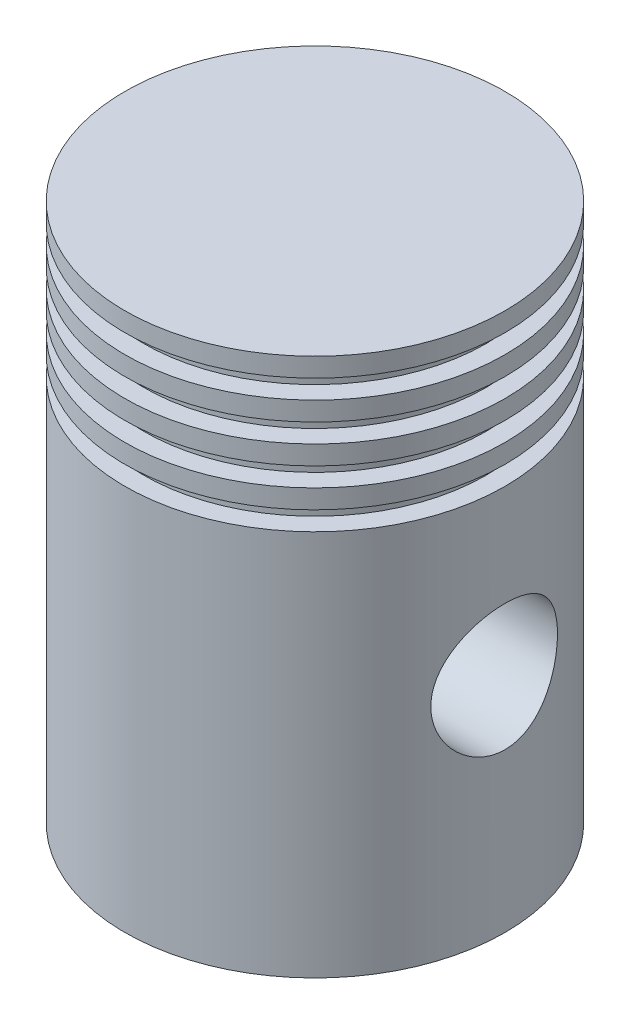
ISO-10303-21;
HEADER;
FILE_DESCRIPTION(('STEP AP214'),'2;1');
FILE_NAME('part.step','',(''),(''),'','','');
FILE_SCHEMA(('AUTOMOTIVE_DESIGN { 1 0 10303 214 1 1 1 1 }'));
ENDSEC;
DATA;
#1=APPLICATION_CONTEXT('core data for automotive mechanical design processes');
#2=APPLICATION_PROTOCOL_DEFINITION('international standard','automotive_design',2000,#1);
#3=PRODUCT_CONTEXT('',#1,'mechanical');
#4=PRODUCT('Part','Part','',(#3));
#5=PRODUCT_RELATED_PRODUCT_CATEGORY('part','',(#4));
#6=PRODUCT_DEFINITION_FORMATION('','',#4);
#7=PRODUCT_DEFINITION_CONTEXT('part definition',#1,'design');
#8=PRODUCT_DEFINITION('design','',#6,#7);
#9=PRODUCT_DEFINITION_SHAPE('','',#8);
#10=(LENGTH_UNIT() NAMED_UNIT(*) SI_UNIT(.MILLI.,.METRE.));
#11=(NAMED_UNIT(*) PLANE_ANGLE_UNIT() SI_UNIT($,.RADIAN.));
#12=(NAMED_UNIT(*) SI_UNIT($,.STERADIAN.) SOLID_ANGLE_UNIT());
#13=UNCERTAINTY_MEASURE_WITH_UNIT(LENGTH_MEASURE(1.E-05),#10,'distance_accuracy_value','');
#14=(GEOMETRIC_REPRESENTATION_CONTEXT(3) GLOBAL_UNCERTAINTY_ASSIGNED_CONTEXT((#13)) GLOBAL_UNIT_ASSIGNED_CONTEXT((#10,
#11,#12)) REPRESENTATION_CONTEXT('',''));
#15=CARTESIAN_POINT('',(0.,0.,0.));
#16=DIRECTION('',(0.,0.,1.));
#17=DIRECTION('',(1.,0.,0.));
#18=AXIS2_PLACEMENT_3D('',#15,#16,#17);
#19=CARTESIAN_POINT('',(-30.002,35.,0.));
#20=DIRECTION('',(1.,0.,0.));
#21=DIRECTION('',(0.,0.,-1.));
#22=AXIS2_PLACEMENT_3D('',#19,#20,#21);
#23=CYLINDRICAL_SURFACE('',#22,13.);
#24=CARTESIAN_POINT('',(-10.,35.,0.));
#25=DIRECTION('',(-1.,0.,0.));
#26=DIRECTION('',(0.,0.,1.));
#27=AXIS2_PLACEMENT_3D('',#24,#25,#26);
#28=CIRCLE('',#27,13.);
#29=CARTESIAN_POINT('',(-10.,35.,13.));
#30=VERTEX_POINT('',#29);
#31=EDGE_CURVE('E125',#30,#30,#28,.F.);
#32=ORIENTED_EDGE('',*,*,#31,.F.);
#33=EDGE_LOOP('',(#32));
#34=FACE_BOUND('',#33,.T.);
#35=CARTESIAN_POINT('',(-20.1742410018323,35.,-13.));
#36=CARTESIAN_POINT('',(-20.1742378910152,35.3342486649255,-13.0000024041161));
#37=CARTESIAN_POINT('',(-20.1825748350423,35.6684702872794,-12.9870936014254));
#38=CARTESIAN_POINT('',(-20.2155793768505,36.3342437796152,-12.9356596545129));
#39=CARTESIAN_POINT('',(-20.2402527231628,36.6657946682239,-12.8971254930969));
#40=CARTESIAN_POINT('',(-20.3050080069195,37.3239632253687,-12.7949322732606));
#41=CARTESIAN_POINT('',(-20.345113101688,37.6505727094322,-12.7312354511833));
#42=CARTESIAN_POINT('',(-20.4392212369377,38.2960168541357,-12.5795937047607));
#43=CARTESIAN_POINT('',(-20.4932234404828,38.6148519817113,-12.4916502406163));
#44=CARTESIAN_POINT('',(-20.61288246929,39.2408431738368,-12.293184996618));
#45=CARTESIAN_POINT('',(-20.6784634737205,39.5480603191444,-12.1828094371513));
#46=CARTESIAN_POINT('',(-20.8195059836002,40.1514999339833,-11.9401781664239));
#47=CARTESIAN_POINT('',(-20.8949713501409,40.4477180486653,-11.8079138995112));
#48=CARTESIAN_POINT('',(-21.0536407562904,41.02773652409,-11.5226227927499));
#49=CARTESIAN_POINT('',(-21.1368435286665,41.3115389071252,-11.3695993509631));
#50=CARTESIAN_POINT('',(-21.308901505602,41.8657624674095,-11.0437611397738));
#51=CARTESIAN_POINT('',(-21.3977572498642,42.1361823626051,-10.8709444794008));
#52=CARTESIAN_POINT('',(-21.5879571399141,42.6885345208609,-10.4885675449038));
#53=CARTESIAN_POINT('',(-21.6896716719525,42.9689969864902,-10.2770660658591));
#54=CARTESIAN_POINT('',(-21.8947832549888,43.5114372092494,-9.83251594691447));
#55=CARTESIAN_POINT('',(-21.9981797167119,43.7734212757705,-9.59947472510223));
#56=CARTESIAN_POINT('',(-22.2042882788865,44.2781209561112,-9.11260220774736));
#57=CARTESIAN_POINT('',(-22.3069996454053,44.5208182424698,-8.85875159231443));
#58=CARTESIAN_POINT('',(-22.5091941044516,44.9853659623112,-8.33161715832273));
#59=CARTESIAN_POINT('',(-22.6086783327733,45.2072237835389,-8.05834028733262));
#60=CARTESIAN_POINT('',(-22.8101783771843,45.6463799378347,-7.46995849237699));
#61=CARTESIAN_POINT('',(-22.9117197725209,45.8617738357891,-7.15326424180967));
#62=CARTESIAN_POINT('',(-23.1055469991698,46.2648807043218,-6.49998294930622));
#63=CARTESIAN_POINT('',(-23.1978321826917,46.4525917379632,-6.16339451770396));
#64=CARTESIAN_POINT('',(-23.3704426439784,46.7983054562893,-5.47257470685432));
#65=CARTESIAN_POINT('',(-23.4507746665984,46.9563249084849,-5.11835342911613));
#66=CARTESIAN_POINT('',(-23.5971085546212,47.2408508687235,-4.39462110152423));
#67=CARTESIAN_POINT('',(-23.6631122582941,47.3673614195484,-4.0251120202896));
#68=CARTESIAN_POINT('',(-23.7740083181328,47.578188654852,-3.30431747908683));
#69=CARTESIAN_POINT('',(-23.8201789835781,47.6650957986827,-2.95398562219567));
#70=CARTESIAN_POINT('',(-23.8973588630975,47.8096646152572,-2.24568569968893));
#71=CARTESIAN_POINT('',(-23.9283688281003,47.8673277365,-1.88771801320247));
#72=CARTESIAN_POINT('',(-23.9743052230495,47.9525518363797,-1.16741192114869));
#73=CARTESIAN_POINT('',(-23.9892415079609,47.9801312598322,-0.805076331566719));
#74=CARTESIAN_POINT('',(-24.0026148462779,48.0048312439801,-0.0790750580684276));
#75=CARTESIAN_POINT('',(-24.0010531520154,48.0019541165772,0.284590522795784));
#76=CARTESIAN_POINT('',(-23.9824838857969,47.9676403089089,0.97299527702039));
#77=CARTESIAN_POINT('',(-23.9670646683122,47.9391404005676,1.29792889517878));
#78=CARTESIAN_POINT('',(-23.9233394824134,47.8579681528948,1.9438592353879));
#79=CARTESIAN_POINT('',(-23.8950345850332,47.8052978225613,2.2648562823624));
#80=CARTESIAN_POINT('',(-23.8262035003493,47.6763929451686,2.90074490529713));
#81=CARTESIAN_POINT('',(-23.7856768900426,47.6001575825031,3.21563626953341));
#82=CARTESIAN_POINT('',(-23.6933261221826,47.4249443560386,3.83732572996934));
#83=CARTESIAN_POINT('',(-23.6415015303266,47.3259656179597,4.14412351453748));
#84=CARTESIAN_POINT('',(-23.5270453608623,47.1049945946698,4.75127959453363));
#85=CARTESIAN_POINT('',(-23.4642981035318,46.9827545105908,5.05152570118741));
#86=CARTESIAN_POINT('',(-23.3297536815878,46.7171037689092,5.64037392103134));
#87=CARTESIAN_POINT('',(-23.257956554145,46.57369319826,5.92897608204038));
#88=CARTESIAN_POINT('',(-23.1067776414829,46.2668097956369,6.49323881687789));
#89=CARTESIAN_POINT('',(-23.02739544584,46.1033358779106,6.76889868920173));
#90=CARTESIAN_POINT('',(-22.8625847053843,45.7573658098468,7.3062468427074));
#91=CARTESIAN_POINT('',(-22.7771538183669,45.5748622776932,7.56792964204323));
#92=CARTESIAN_POINT('',(-22.5926518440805,45.1716938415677,8.10311171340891));
#93=CARTESIAN_POINT('',(-22.4930928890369,44.9490342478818,8.37494200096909));
#94=CARTESIAN_POINT('',(-22.2909168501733,44.4830919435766,8.89909839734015));
#95=CARTESIAN_POINT('',(-22.1882995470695,44.2398077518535,9.15142310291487));
#96=CARTESIAN_POINT('',(-21.9823208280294,43.7336088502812,9.63570801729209));
#97=CARTESIAN_POINT('',(-21.8789588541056,43.4706776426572,9.86765074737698));
#98=CARTESIAN_POINT('',(-21.6740667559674,42.9264574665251,10.3099100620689));
#99=CARTESIAN_POINT('',(-21.5725369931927,42.6451649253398,10.520222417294));
#100=CARTESIAN_POINT('',(-21.3656109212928,42.0410553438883,10.9347490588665));
#101=CARTESIAN_POINT('',(-21.2606042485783,41.7167341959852,11.1369733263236));
#102=CARTESIAN_POINT('',(-21.0593584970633,41.0495983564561,11.5129881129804));
#103=CARTESIAN_POINT('',(-20.9631154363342,40.7067921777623,11.68679157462));
#104=CARTESIAN_POINT('',(-20.782954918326,40.0046218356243,12.0042533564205));
#105=CARTESIAN_POINT('',(-20.6990294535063,39.6452686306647,12.1479312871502));
#106=CARTESIAN_POINT('',(-20.5469392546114,38.91218044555,12.4034447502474));
#107=CARTESIAN_POINT('',(-20.4787720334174,38.5384477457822,12.5152853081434));
#108=CARTESIAN_POINT('',(-20.3661343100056,37.8103549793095,12.6976817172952));
#109=CARTESIAN_POINT('',(-20.3201918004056,37.4568771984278,12.7708475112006));
#110=CARTESIAN_POINT('',(-20.2463051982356,36.743203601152,12.8876661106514));
#111=CARTESIAN_POINT('',(-20.2183599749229,36.3830082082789,12.9313207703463));
#112=CARTESIAN_POINT('',(-20.1817900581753,35.659569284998,12.9883219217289));
#113=CARTESIAN_POINT('',(-20.1731479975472,35.2963287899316,13.0016956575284));
#114=CARTESIAN_POINT('',(-20.1755551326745,34.570089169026,12.9979611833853));
#115=CARTESIAN_POINT('',(-20.1866023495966,34.2070900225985,12.9808560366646));
#116=CARTESIAN_POINT('',(-20.2249642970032,33.535213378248,12.920984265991));
#117=CARTESIAN_POINT('',(-20.2498009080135,33.225834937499,12.8821205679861));
#118=CARTESIAN_POINT('',(-20.3127899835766,32.6119805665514,12.7825676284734));
#119=CARTESIAN_POINT('',(-20.3509428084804,32.3075047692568,12.7218777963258));
#120=CARTESIAN_POINT('',(-20.4393362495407,31.7052700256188,12.5793698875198));
#121=CARTESIAN_POINT('',(-20.4895800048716,31.4075128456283,12.497546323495));
#122=CARTESIAN_POINT('',(-20.6006381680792,30.8203555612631,12.3136199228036));
#123=CARTESIAN_POINT('',(-20.6614532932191,30.5309560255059,12.2115157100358));
#124=CARTESIAN_POINT('',(-20.7947905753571,29.9495744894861,11.9831091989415));
#125=CARTESIAN_POINT('',(-20.867704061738,29.6580178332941,11.8559542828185));
#126=CARTESIAN_POINT('',(-21.0212535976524,29.0865490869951,11.5815205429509));
#127=CARTESIAN_POINT('',(-21.101892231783,28.8066409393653,11.4342349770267));
#128=CARTESIAN_POINT('',(-21.2689060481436,28.2595063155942,11.1204863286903));
#129=CARTESIAN_POINT('',(-21.3552824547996,27.9922825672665,10.9540191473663));
#130=CARTESIAN_POINT('',(-21.5318188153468,27.4714367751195,10.6028021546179));
#131=CARTESIAN_POINT('',(-21.6219790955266,27.2178159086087,10.4180507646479));
#132=CARTESIAN_POINT('',(-21.8181597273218,26.6872503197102,10.0014351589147));
#133=CARTESIAN_POINT('',(-21.9244949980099,26.4126791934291,9.76668841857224));
#134=CARTESIAN_POINT('',(-22.136890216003,25.884053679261,9.27522149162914));
#135=CARTESIAN_POINT('',(-22.2429502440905,25.6299924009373,9.01850874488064));
#136=CARTESIAN_POINT('',(-22.4522942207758,25.1433365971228,8.4839231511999));
#137=CARTESIAN_POINT('',(-22.5555754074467,24.9107629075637,8.20603023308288));
#138=CARTESIAN_POINT('',(-22.756667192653,24.4688750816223,7.630657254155));
#139=CARTESIAN_POINT('',(-22.854480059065,24.2595512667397,7.33318542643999));
#140=CARTESIAN_POINT('',(-23.0466022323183,23.8564495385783,6.70571988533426));
#141=CARTESIAN_POINT('',(-23.1405391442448,23.6638415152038,6.37485789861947));
#142=CARTESIAN_POINT('',(-23.3171660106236,23.3075161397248,5.69500671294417));
#143=CARTESIAN_POINT('',(-23.3998554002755,23.1438002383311,5.34601660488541));
#144=CARTESIAN_POINT('',(-23.5514775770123,22.8472916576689,4.63257707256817));
#145=CARTESIAN_POINT('',(-23.6204216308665,22.7144736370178,4.26814060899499));
#146=CARTESIAN_POINT('',(-23.7424819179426,22.4814010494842,3.52643233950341));
#147=CARTESIAN_POINT('',(-23.7956004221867,22.381141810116,3.1491623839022));
#148=CARTESIAN_POINT('',(-23.8798264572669,22.2230636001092,2.42355258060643));
#149=CARTESIAN_POINT('',(-23.9126088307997,22.1619935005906,2.076112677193));
#150=CARTESIAN_POINT('',(-23.9630696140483,22.0682454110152,1.37633767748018));
#151=CARTESIAN_POINT('',(-23.980749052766,22.0355654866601,1.02400291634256));
#152=CARTESIAN_POINT('',(-24.0004996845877,21.9990685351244,0.317552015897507));
#153=CARTESIAN_POINT('',(-24.0025773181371,21.9952395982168,-0.0365633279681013));
#154=CARTESIAN_POINT('',(-23.9910810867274,22.0164698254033,-0.74366286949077));
#155=CARTESIAN_POINT('',(-23.9775079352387,22.0415276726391,-1.09664711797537));
#156=CARTESIAN_POINT('',(-23.9369135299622,22.1168045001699,-1.7685065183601));
#157=CARTESIAN_POINT('',(-23.9111386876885,22.1646939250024,-2.08772195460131));
#158=CARTESIAN_POINT('',(-23.8474297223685,22.2837727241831,-2.72051508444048));
#159=CARTESIAN_POINT('',(-23.8094964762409,22.3549604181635,-3.03409318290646));
#160=CARTESIAN_POINT('',(-23.7223238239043,22.5198740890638,-3.65366122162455));
#161=CARTESIAN_POINT('',(-23.6730837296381,22.6136014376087,-3.95965069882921));
#162=CARTESIAN_POINT('',(-23.5643666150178,22.8226709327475,-4.56227894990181));
#163=CARTESIAN_POINT('',(-23.504889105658,22.9380141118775,-4.85891727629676));
#164=CARTESIAN_POINT('',(-23.3746310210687,23.1938183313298,-5.4517911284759));
#165=CARTESIAN_POINT('',(-23.3035208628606,23.3350335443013,-5.74762846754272));
#166=CARTESIAN_POINT('',(-23.153157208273,23.6383962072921,-6.326188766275));
#167=CARTESIAN_POINT('',(-23.0739036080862,23.8005439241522,-6.60891155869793));
#168=CARTESIAN_POINT('',(-22.9088624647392,24.1446430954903,-7.16008348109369));
#169=CARTESIAN_POINT('',(-22.8230738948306,24.3265976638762,-7.4285303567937));
#170=CARTESIAN_POINT('',(-22.6466495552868,24.7092483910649,-7.95016430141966));
#171=CARTESIAN_POINT('',(-22.5560120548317,24.9099512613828,-8.2033458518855));
#172=CARTESIAN_POINT('',(-22.3613027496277,25.3526319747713,-8.72106542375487));
#173=CARTESIAN_POINT('',(-22.2568674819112,25.5967126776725,-8.98367170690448));
#174=CARTESIAN_POINT('',(-22.0467560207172,26.1054444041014,-9.48762885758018));
#175=CARTESIAN_POINT('',(-21.9410797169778,26.3700972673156,-9.72897782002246));
#176=CARTESIAN_POINT('',(-21.7310199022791,26.919059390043,-10.1895491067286));
#177=CARTESIAN_POINT('',(-21.626638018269,27.2033909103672,-10.4087456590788));
#178=CARTESIAN_POINT('',(-21.422074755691,27.7902213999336,-10.823501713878));
#179=CARTESIAN_POINT('',(-21.3218932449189,28.0927197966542,-11.0190619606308));
#180=CARTESIAN_POINT('',(-21.1227920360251,28.7333809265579,-11.3963088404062));
#181=CARTESIAN_POINT('',(-21.0243119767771,29.072594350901,-11.5764498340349));
#182=CARTESIAN_POINT('',(-20.8388599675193,29.7683212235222,-11.9070514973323));
#183=CARTESIAN_POINT('',(-20.7518899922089,30.1248376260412,-12.0575070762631));
#184=CARTESIAN_POINT('',(-20.5932411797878,30.8518662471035,-12.3265067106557));
#185=CARTESIAN_POINT('',(-20.5215200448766,31.22233630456,-12.4451392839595));
#186=CARTESIAN_POINT('',(-20.3963798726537,31.975124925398,-12.649192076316));
#187=CARTESIAN_POINT('',(-20.3429489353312,32.3574356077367,-12.7346338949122));
#188=CARTESIAN_POINT('',(-20.2587918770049,33.1146946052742,-12.8680740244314));
#189=CARTESIAN_POINT('',(-20.2272261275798,33.489304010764,-12.9174614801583));
#190=CARTESIAN_POINT('',(-20.184952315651,34.2426204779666,-12.9834233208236));
#191=CARTESIAN_POINT('',(-20.1742445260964,34.6213275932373,-12.9999972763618));
#192=CARTESIAN_POINT('',(-20.1742410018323,35.,-13.));
#193=B_SPLINE_CURVE_WITH_KNOTS('',3,(#35,#36,#37,#38,#39,#40,#41,#42,#43,#44,#45,#46,#47,#48,
#49,#50,#51,#52,#53,#54,#55,#56,#57,#58,#59,#60,#61,#62,#63,#64,#65,#66,#67,#68,#69,#70,#71,#72,
#73,#74,#75,#76,#77,#78,#79,#80,#81,#82,#83,#84,#85,#86,#87,#88,#89,#90,#91,#92,#93,#94,#95,#96,
#97,#98,#99,#100,#101,#102,#103,#104,#105,#106,#107,#108,#109,#110,#111,#112,#113,#114,#115,
#116,#117,#118,#119,#120,#121,#122,#123,#124,#125,#126,#127,#128,#129,#130,#131,#132,#133,#134,
#135,#136,#137,#138,#139,#140,#141,#142,#143,#144,#145,#146,#147,#148,#149,#150,#151,#152,#153,
#154,#155,#156,#157,#158,#159,#160,#161,#162,#163,#164,#165,#166,#167,#168,#169,#170,#171,#172,
#173,#174,#175,#176,#177,#178,#179,#180,#181,#182,#183,#184,#185,#186,#187,#188,#189,#190,#191,
#192),.UNSPECIFIED.,.T.,.F.,(4,2,2,2,2,2,2,2,2,2,2,2,2,2,2,2,2,2,2,2,2,2,2,2,2,2,2,2,2,2,2,2,2,
2,2,2,2,2,2,2,2,2,2,2,2,2,2,2,2,2,2,2,2,2,2,2,2,2,2,2,2,2,2,2,2,2,2,2,2,2,2,2,2,2,2,2,2,2,4),
(0.,1.00235057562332,2.00505405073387,3.00926811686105,4.013421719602,5.01122853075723,
6.00942628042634,7.0074608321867,8.0055908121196,9.10155910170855,10.1971513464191,
11.2937725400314,12.3900034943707,13.5771585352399,14.7643966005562,15.9509621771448,
17.1373754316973,18.2275364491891,19.3176434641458,20.4070817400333,21.4964373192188,
22.4749117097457,23.4533047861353,24.4317317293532,25.4101962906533,26.3997356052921,
27.3892708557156,28.378859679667,29.3688338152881,30.4633192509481,31.5578833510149,
32.6533771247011,33.7490846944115,34.9366680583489,36.1237090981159,37.3099750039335,
38.4960535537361,39.5860767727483,40.6760315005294,41.7650051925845,42.8538694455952,
43.7911849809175,44.7285258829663,45.6661104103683,46.6037585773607,47.5817798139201,
48.5601294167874,49.5386884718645,50.5173320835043,51.6458007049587,52.7738886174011,
53.9030591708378,55.0317578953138,56.2127602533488,57.3938218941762,58.5739114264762,
59.7538315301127,60.8152477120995,61.876591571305,62.9374972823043,63.9983546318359,
64.9686852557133,65.9389459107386,66.9092656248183,67.8796317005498,68.8848971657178,
69.8901754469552,70.8956120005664,71.9014098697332,73.0204704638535,74.1396312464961,
75.2600794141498,76.3804922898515,77.568405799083,78.7565228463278,79.941299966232,
81.1253047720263,82.2608591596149,83.396428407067),.UNSPECIFIED.);
#194=CARTESIAN_POINT('',(-20.1742410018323,35.,-13.));
#195=VERTEX_POINT('',#194);
#196=EDGE_CURVE('E91',#195,#195,#193,.T.);
#197=ORIENTED_EDGE('',*,*,#196,.T.);
#198=EDGE_LOOP('',(#197));
#199=FACE_BOUND('',#198,.T.);
#200=ADVANCED_FACE('F39',(#34,#199),#23,.T.);
#201=CARTESIAN_POINT('',(-30.0000000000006,35.,0.));
#202=DIRECTION('',(1.,0.,0.));
#203=DIRECTION('',(0.,0.,-1.));
#204=AXIS2_PLACEMENT_3D('',#201,#202,#203);
#205=CYLINDRICAL_SURFACE('',#204,10.);
#206=CARTESIAN_POINT('',(-10.,35.,0.));
#207=DIRECTION('',(-1.,0.,0.));
#208=DIRECTION('',(0.,0.,1.));
#209=AXIS2_PLACEMENT_3D('',#206,#207,#208);
#210=CIRCLE('',#209,10.);
#211=CARTESIAN_POINT('',(-10.,35.,10.));
#212=VERTEX_POINT('',#211);
#213=EDGE_CURVE('E43',#212,#212,#210,.F.);
#214=ORIENTED_EDGE('',*,*,#213,.T.);
#215=EDGE_LOOP('',(#214));
#216=FACE_BOUND('',#215,.T.);
#217=CARTESIAN_POINT('',(-30.0000000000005,25.,0.));
#218=CARTESIAN_POINT('',(-30.000000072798,24.9999998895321,0.272817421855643));
#219=CARTESIAN_POINT('',(-29.9962700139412,25.0111733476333,0.545633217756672));
#220=CARTESIAN_POINT('',(-29.981452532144,25.0557586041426,1.08923625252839));
#221=CARTESIAN_POINT('',(-29.9703651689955,25.0891702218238,1.36002350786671));
#222=CARTESIAN_POINT('',(-29.9411347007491,25.1779177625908,1.89761112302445));
#223=CARTESIAN_POINT('',(-29.9229910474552,25.2332553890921,2.16441117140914));
#224=CARTESIAN_POINT('',(-29.8801375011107,25.3653481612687,2.69211184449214));
#225=CARTESIAN_POINT('',(-29.8554275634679,25.4421034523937,2.95301242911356));
#226=CARTESIAN_POINT('',(-29.8001502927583,25.6161973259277,3.46664728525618));
#227=CARTESIAN_POINT('',(-29.7695941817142,25.7134965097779,3.71939613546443));
#228=CARTESIAN_POINT('',(-29.7033758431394,25.9280132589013,4.21570540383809));
#229=CARTESIAN_POINT('',(-29.6677117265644,26.0452381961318,4.45926238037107));
#230=CARTESIAN_POINT('',(-29.5921987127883,26.2986867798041,4.93557741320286));
#231=CARTESIAN_POINT('',(-29.552350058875,26.4349093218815,5.16833609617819));
#232=CARTESIAN_POINT('',(-29.4694667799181,26.7254094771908,5.62171195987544));
#233=CARTESIAN_POINT('',(-29.4264319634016,26.8796881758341,5.84232840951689));
#234=CARTESIAN_POINT('',(-29.3368734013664,27.2103752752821,6.27682953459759));
#235=CARTESIAN_POINT('',(-29.2902826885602,27.3873240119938,6.49028930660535));
#236=CARTESIAN_POINT('',(-29.1960870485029,27.7582003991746,6.90166928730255));
#237=CARTESIAN_POINT('',(-29.1484821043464,27.9521283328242,7.099589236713));
#238=CARTESIAN_POINT('',(-29.0535150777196,28.355812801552,7.47873453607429));
#239=CARTESIAN_POINT('',(-29.0061530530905,28.5655729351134,7.65995606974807));
#240=CARTESIAN_POINT('',(-28.9129673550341,28.9996166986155,8.00450980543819));
#241=CARTESIAN_POINT('',(-28.8671436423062,29.2238999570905,8.16784246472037));
#242=CARTESIAN_POINT('',(-28.7770145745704,29.692372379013,8.48001162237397));
#243=CARTESIAN_POINT('',(-28.7327920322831,29.9369505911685,8.6282889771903));
#244=CARTESIAN_POINT('',(-28.6486860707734,30.438392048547,8.90356690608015));
#245=CARTESIAN_POINT('',(-28.6088009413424,30.6952503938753,9.03057587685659));
#246=CARTESIAN_POINT('',(-28.5346119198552,31.2196006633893,9.26232893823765));
#247=CARTESIAN_POINT('',(-28.5003078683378,31.4870922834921,9.36707366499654));
#248=CARTESIAN_POINT('',(-28.4384115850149,32.0307959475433,9.55334459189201));
#249=CARTESIAN_POINT('',(-28.4108190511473,32.307007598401,9.63487183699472));
#250=CARTESIAN_POINT('',(-28.3640896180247,32.8566360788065,9.77156399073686));
#251=CARTESIAN_POINT('',(-28.3446991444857,33.1298335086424,9.82752458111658));
#252=CARTESIAN_POINT('',(-28.3137046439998,33.680382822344,9.91646893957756));
#253=CARTESIAN_POINT('',(-28.3021004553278,33.957734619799,9.94945318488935));
#254=CARTESIAN_POINT('',(-28.2870721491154,34.5143726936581,9.99210001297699));
#255=CARTESIAN_POINT('',(-28.2836458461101,34.7936584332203,10.001768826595));
#256=CARTESIAN_POINT('',(-28.2850842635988,35.3520337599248,9.99770051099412));
#257=CARTESIAN_POINT('',(-28.2899487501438,35.6311233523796,9.98396404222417));
#258=CARTESIAN_POINT('',(-28.3073918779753,36.1741814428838,9.93439524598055));
#259=CARTESIAN_POINT('',(-28.3196072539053,36.4382573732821,9.89960301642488));
#260=CARTESIAN_POINT('',(-28.3510582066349,36.9623784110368,9.80916853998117));
#261=CARTESIAN_POINT('',(-28.3702935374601,37.2224236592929,9.75352702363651));
#262=CARTESIAN_POINT('',(-28.4152063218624,37.7367087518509,9.62189570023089));
#263=CARTESIAN_POINT('',(-28.4408831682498,37.990949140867,9.54590781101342));
#264=CARTESIAN_POINT('',(-28.4979443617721,38.4921119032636,9.37418519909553));
#265=CARTESIAN_POINT('',(-28.5293308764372,38.7390314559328,9.27844297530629));
#266=CARTESIAN_POINT('',(-28.5974561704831,39.227762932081,9.06631661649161));
#267=CARTESIAN_POINT('',(-28.6342713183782,39.4694335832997,8.94963170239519));
#268=CARTESIAN_POINT('',(-28.7118622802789,39.9422102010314,8.69749161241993));
#269=CARTESIAN_POINT('',(-28.7526394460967,40.173312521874,8.56203002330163));
#270=CARTESIAN_POINT('',(-28.8370515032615,40.6235621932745,8.27327503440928));
#271=CARTESIAN_POINT('',(-28.8806865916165,40.8427087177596,8.11998040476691));
#272=CARTESIAN_POINT('',(-28.9696785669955,41.2678135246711,7.79652835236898));
#273=CARTESIAN_POINT('',(-29.015035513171,41.4737713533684,7.62637034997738));
#274=CARTESIAN_POINT('',(-29.1087179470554,41.8817825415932,7.26085153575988));
#275=CARTESIAN_POINT('',(-29.1570743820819,42.0830648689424,7.0646370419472));
#276=CARTESIAN_POINT('',(-29.2530762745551,42.468419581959,6.65594240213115));
#277=CARTESIAN_POINT('',(-29.3007219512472,42.6524973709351,6.44346740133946));
#278=CARTESIAN_POINT('',(-29.3940440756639,43.002391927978,6.00339730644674));
#279=CARTESIAN_POINT('',(-29.439719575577,43.1681999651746,5.77579506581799));
#280=CARTESIAN_POINT('',(-29.5278149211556,43.4802271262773,5.30706897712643));
#281=CARTESIAN_POINT('',(-29.5702360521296,43.6264540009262,5.06595053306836));
#282=CARTESIAN_POINT('',(-29.6510879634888,43.8996756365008,4.5691305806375));
#283=CARTESIAN_POINT('',(-29.6894737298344,44.0264594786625,4.31330561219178));
#284=CARTESIAN_POINT('',(-29.7606637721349,44.2579286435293,3.79108523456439));
#285=CARTESIAN_POINT('',(-29.7934679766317,44.3626136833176,3.52468969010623));
#286=CARTESIAN_POINT('',(-29.8525359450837,44.5489114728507,2.98332200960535));
#287=CARTESIAN_POINT('',(-29.8788015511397,44.6305307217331,2.70835231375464));
#288=CARTESIAN_POINT('',(-29.9240279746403,44.7699439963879,2.15185145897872));
#289=CARTESIAN_POINT('',(-29.9429891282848,44.8277391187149,1.87032060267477));
#290=CARTESIAN_POINT('',(-29.9723879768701,44.9169416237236,1.31523069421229));
#291=CARTESIAN_POINT('',(-29.9831596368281,44.949384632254,1.04185537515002));
#292=CARTESIAN_POINT('',(-29.997201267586,44.9916207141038,0.493170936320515));
#293=CARTESIAN_POINT('',(-30.0004714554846,45.0014144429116,0.217861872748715));
#294=CARTESIAN_POINT('',(-29.9994188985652,44.9982566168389,-0.332568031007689));
#295=CARTESIAN_POINT('',(-29.9950972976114,44.9853084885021,-0.607688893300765));
#296=CARTESIAN_POINT('',(-29.9789840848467,44.9368007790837,-1.15570622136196));
#297=CARTESIAN_POINT('',(-29.967192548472,44.9012414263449,-1.42860270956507));
#298=CARTESIAN_POINT('',(-29.9369169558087,44.8092212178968,-1.96222703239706));
#299=CARTESIAN_POINT('',(-29.9186384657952,44.7534012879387,-2.22307746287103));
#300=CARTESIAN_POINT('',(-29.8758162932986,44.6212424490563,-2.73909747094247));
#301=CARTESIAN_POINT('',(-29.8512703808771,44.5448962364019,-2.99426499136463));
#302=CARTESIAN_POINT('',(-29.7965488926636,44.372353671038,-3.49708740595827));
#303=CARTESIAN_POINT('',(-29.766374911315,44.2761629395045,-3.74474440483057));
#304=CARTESIAN_POINT('',(-29.7011345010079,44.0646297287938,-4.23117712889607));
#305=CARTESIAN_POINT('',(-29.666066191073,43.949279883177,-4.46994939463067));
#306=CARTESIAN_POINT('',(-29.5909467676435,43.6970680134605,-4.9431506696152));
#307=CARTESIAN_POINT('',(-29.5507901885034,43.5597265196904,-5.17730735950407));
#308=CARTESIAN_POINT('',(-29.4672484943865,43.2667077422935,-5.63338688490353));
#309=CARTESIAN_POINT('',(-29.4238619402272,43.1110222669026,-5.85530418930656));
#310=CARTESIAN_POINT('',(-29.334970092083,42.7823833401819,-6.28552190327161));
#311=CARTESIAN_POINT('',(-29.2894647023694,42.6094291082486,-6.49382169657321));
#312=CARTESIAN_POINT('',(-29.1974842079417,42.2473266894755,-6.8956072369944));
#313=CARTESIAN_POINT('',(-29.1510090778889,42.058178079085,-7.08909259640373));
#314=CARTESIAN_POINT('',(-29.0561491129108,41.6558052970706,-7.46861368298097));
#315=CARTESIAN_POINT('',(-29.0077740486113,41.4418759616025,-7.65390507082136));
#316=CARTESIAN_POINT('',(-28.9126373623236,40.998946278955,-8.00578656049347));
#317=CARTESIAN_POINT('',(-28.8658751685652,40.7699513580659,-8.17238333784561));
#318=CARTESIAN_POINT('',(-28.7752794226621,40.2981425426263,-8.48586679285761));
#319=CARTESIAN_POINT('',(-28.7314471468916,40.0553227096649,-8.63274490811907));
#320=CARTESIAN_POINT('',(-28.6480650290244,39.5576069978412,-8.90554413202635));
#321=CARTESIAN_POINT('',(-28.6085133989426,39.3027162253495,-9.03147400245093));
#322=CARTESIAN_POINT('',(-28.5349686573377,38.7829217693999,-9.26121465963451));
#323=CARTESIAN_POINT('',(-28.5009658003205,38.5180366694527,-9.36506432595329));
#324=CARTESIAN_POINT('',(-28.4395326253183,37.9796830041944,-9.54999948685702));
#325=CARTESIAN_POINT('',(-28.4121023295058,37.7062144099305,-9.63108490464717));
#326=CARTESIAN_POINT('',(-28.3647445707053,37.1528332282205,-9.76967941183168));
#327=CARTESIAN_POINT('',(-28.3448142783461,36.8729231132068,-9.82719739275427));
#328=CARTESIAN_POINT('',(-28.3131339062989,36.308757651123,-9.91810350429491));
#329=CARTESIAN_POINT('',(-28.3013834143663,36.0245025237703,-9.95149285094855));
#330=CARTESIAN_POINT('',(-28.2868595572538,35.4686336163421,-9.99269827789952));
#331=CARTESIAN_POINT('',(-28.2836556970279,35.1971213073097,-10.0017409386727));
#332=CARTESIAN_POINT('',(-28.2850819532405,34.6542875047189,-9.99770707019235));
#333=CARTESIAN_POINT('',(-28.2897117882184,34.3829660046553,-9.98463133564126));
#334=CARTESIAN_POINT('',(-28.3066557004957,33.8425445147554,-9.9364928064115));
#335=CARTESIAN_POINT('',(-28.3189692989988,33.573444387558,-9.9014313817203));
#336=CARTESIAN_POINT('',(-28.3508886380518,33.0394036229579,-9.80966197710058));
#337=CARTESIAN_POINT('',(-28.3704944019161,32.7744629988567,-9.7529539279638));
#338=CARTESIAN_POINT('',(-28.415945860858,32.2556454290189,-9.61971250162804));
#339=CARTESIAN_POINT('',(-28.4416642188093,32.0016536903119,-9.54358162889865));
#340=CARTESIAN_POINT('',(-28.4987919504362,31.5009969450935,-9.37160938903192));
#341=CARTESIAN_POINT('',(-28.5302033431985,31.2543345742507,-9.27576102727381));
#342=CARTESIAN_POINT('',(-28.5978301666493,30.76993896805,-9.06511647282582));
#343=CARTESIAN_POINT('',(-28.6340454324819,30.5322054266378,-8.95032093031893));
#344=CARTESIAN_POINT('',(-28.7103060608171,30.067015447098,-8.70259247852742));
#345=CARTESIAN_POINT('',(-28.7503516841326,29.839559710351,-8.56965833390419));
#346=CARTESIAN_POINT('',(-28.8350396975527,29.3865184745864,-8.28034879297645));
#347=CARTESIAN_POINT('',(-28.8798064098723,29.1614474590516,-8.12320375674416));
#348=CARTESIAN_POINT('',(-28.971150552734,28.725203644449,-7.79115386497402));
#349=CARTESIAN_POINT('',(-29.0177280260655,28.5140311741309,-7.61624858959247));
#350=CARTESIAN_POINT('',(-29.1114649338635,28.1067657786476,-7.24971676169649));
#351=CARTESIAN_POINT('',(-29.1586245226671,27.9106769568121,-7.05808568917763));
#352=CARTESIAN_POINT('',(-29.2522781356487,27.5348203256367,-6.65929199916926));
#353=CARTESIAN_POINT('',(-29.2987721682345,27.3550523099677,-6.45212957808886));
#354=CARTESIAN_POINT('',(-29.3916811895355,27.0062342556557,-6.01505765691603));
#355=CARTESIAN_POINT('',(-29.4380213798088,26.8378823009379,-5.78457436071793));
#356=CARTESIAN_POINT('',(-29.5273677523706,26.5212909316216,-5.30969823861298));
#357=CARTESIAN_POINT('',(-29.5703751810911,26.3730439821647,-5.06531067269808));
#358=CARTESIAN_POINT('',(-29.6518631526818,26.0977371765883,-4.56414864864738));
#359=CARTESIAN_POINT('',(-29.6903436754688,25.9706774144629,-4.3073741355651));
#360=CARTESIAN_POINT('',(-29.7616741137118,25.7388217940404,-3.78321180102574));
#361=CARTESIAN_POINT('',(-29.7945243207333,25.6340247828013,-3.51582453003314));
#362=CARTESIAN_POINT('',(-29.8523172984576,25.4518077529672,-2.98451649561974));
#363=CARTESIAN_POINT('',(-29.8775477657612,25.3733738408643,-2.72097451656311));
#364=CARTESIAN_POINT('',(-29.9213145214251,25.238384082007,-2.18780019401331));
#365=CARTESIAN_POINT('',(-29.9398510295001,25.1818275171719,-1.91816805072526));
#366=CARTESIAN_POINT('',(-29.969715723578,25.0911304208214,-1.37482625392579));
#367=CARTESIAN_POINT('',(-29.9810455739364,25.0569847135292,-1.10111755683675));
#368=CARTESIAN_POINT('',(-29.9961876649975,25.0114195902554,-0.551605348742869));
#369=CARTESIAN_POINT('',(-29.9999999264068,25.0000001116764,-0.275801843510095));
#370=CARTESIAN_POINT('',(-30.0000000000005,25.,0.));
#371=B_SPLINE_CURVE_WITH_KNOTS('',3,(#217,#218,#219,#220,#221,#222,#223,#224,#225,#226,#227,
#228,#229,#230,#231,#232,#233,#234,#235,#236,#237,#238,#239,#240,#241,#242,#243,#244,#245,#246,
#247,#248,#249,#250,#251,#252,#253,#254,#255,#256,#257,#258,#259,#260,#261,#262,#263,#264,#265,
#266,#267,#268,#269,#270,#271,#272,#273,#274,#275,#276,#277,#278,#279,#280,#281,#282,#283,#284,
#285,#286,#287,#288,#289,#290,#291,#292,#293,#294,#295,#296,#297,#298,#299,#300,#301,#302,#303,
#304,#305,#306,#307,#308,#309,#310,#311,#312,#313,#314,#315,#316,#317,#318,#319,#320,#321,#322,
#323,#324,#325,#326,#327,#328,#329,#330,#331,#332,#333,#334,#335,#336,#337,#338,#339,#340,#341,
#342,#343,#344,#345,#346,#347,#348,#349,#350,#351,#352,#353,#354,#355,#356,#357,#358,#359,#360,
#361,#362,#363,#364,#365,#366,#367,#368,#369,#370),.UNSPECIFIED.,.T.,.F.,(4,2,2,2,2,2,2,2,2,2,2,
2,2,2,2,2,2,2,2,2,2,2,2,2,2,2,2,2,2,2,2,2,2,2,2,2,2,2,2,2,2,2,2,2,2,2,2,2,2,2,2,2,2,2,2,2,2,2,2,
2,2,2,2,2,2,2,2,2,2,2,2,2,2,2,2,2,4),(0.,0.818196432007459,1.63638621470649,2.45463957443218,
3.2728984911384,4.08960219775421,4.90660872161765,5.72356777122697,6.5405759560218,
7.3830793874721,8.22559687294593,9.068306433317,9.91099444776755,10.7781693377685,
11.645001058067,12.5118080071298,13.3785759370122,14.2161395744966,15.0536858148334,
15.8910082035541,16.7283069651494,17.5272827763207,18.3262305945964,19.1251031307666,
19.9242795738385,20.7360167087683,21.5480317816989,22.3601028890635,23.1722019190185,
24.0268844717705,24.881297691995,25.7361174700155,26.590597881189,27.453776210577,
28.3169655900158,29.1799115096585,30.0428177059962,30.8683037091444,31.6937658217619,
32.5191035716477,33.3444329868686,34.1456526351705,34.9471577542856,35.7484361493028,
36.5500233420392,37.3723552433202,38.1950557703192,39.0177935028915,39.8405527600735,
40.7009055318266,41.5609501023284,42.4213669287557,43.2814229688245,44.1399518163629,
44.998483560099,45.856691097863,46.7148553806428,47.5288973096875,48.3429099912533,
49.1568719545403,49.9708365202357,50.7691377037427,51.5677225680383,52.3662800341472,
53.1648919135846,53.9983437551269,54.8318153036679,55.665512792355,56.4991997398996,
57.3656243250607,58.2317232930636,59.097826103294,59.9638840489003,60.7912515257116,
61.618591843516,62.4457410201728,63.2728879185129),.UNSPECIFIED.);
#372=CARTESIAN_POINT('',(-30.0000000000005,25.,0.));
#373=VERTEX_POINT('',#372);
#374=EDGE_CURVE('E10',#373,#373,#371,.T.);
#375=ORIENTED_EDGE('',*,*,#374,.T.);
#376=EDGE_LOOP('',(#375));
#377=FACE_BOUND('',#376,.T.);
#378=ADVANCED_FACE('F76',(#216,#377),#205,.F.);
#379=CARTESIAN_POINT('',(-2.91571164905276E-13,85.,0.));
#380=DIRECTION('',(0.,1.,0.));
#381=DIRECTION('',(-1.,0.,0.));
#382=AXIS2_PLACEMENT_3D('',#379,#380,#381);
#383=PLANE('',#382);
#384=CARTESIAN_POINT('',(-2.91571164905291E-13,85.0000000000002,0.));
#385=DIRECTION('',(0.,-1.,0.));
#386=DIRECTION('',(1.,0.,0.));
#387=AXIS2_PLACEMENT_3D('',#384,#385,#386);
#388=CIRCLE('',#387,30.0000000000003);
#389=CARTESIAN_POINT('',(30.,85.0000000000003,0.));
#390=VERTEX_POINT('',#389);
#391=EDGE_CURVE('E97',#390,#390,#388,.T.);
#392=ORIENTED_EDGE('',*,*,#391,.F.);
#393=EDGE_LOOP('',(#392));
#394=FACE_BOUND('',#393,.T.);
#395=ADVANCED_FACE('F41',(#394),#383,.T.);
#396=CARTESIAN_POINT('',(6.69607254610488E-12,-1952.06603027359,0.));
#397=DIRECTION('',(0.,-1.,0.));
#398=DIRECTION('',(1.,0.,0.));
#399=AXIS2_PLACEMENT_3D('',#396,#397,#398);
#400=CYLINDRICAL_SURFACE('',#399,30.0000000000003);
#401=ORIENTED_EDGE('',*,*,#391,.T.);
#402=EDGE_LOOP('',(#401));
#403=FACE_BOUND('',#402,.T.);
#404=CARTESIAN_POINT('',(-2.81280417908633E-13,82.0000000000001,0.));
#405=DIRECTION('',(0.,-1.,0.));
#406=DIRECTION('',(1.,0.,0.));
#407=AXIS2_PLACEMENT_3D('',#404,#405,#406);
#408=CIRCLE('',#407,30.0000000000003);
#409=CARTESIAN_POINT('',(30.,82.0000000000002,0.));
#410=VERTEX_POINT('',#409);
#411=EDGE_CURVE('E188',#410,#410,#408,.T.);
#412=ORIENTED_EDGE('',*,*,#411,.F.);
#413=EDGE_LOOP('',(#412));
#414=FACE_BOUND('',#413,.T.);
#415=ADVANCED_FACE('F195',(#403,#414),#400,.T.);
#416=CARTESIAN_POINT('',(30.,82.,0.));
#417=DIRECTION('',(0.,-1.,0.));
#418=DIRECTION('',(1.,0.,0.));
#419=AXIS2_PLACEMENT_3D('',#416,#417,#418);
#420=PLANE('',#419);
#421=ORIENTED_EDGE('',*,*,#411,.T.);
#422=EDGE_LOOP('',(#421));
#423=FACE_BOUND('',#422,.T.);
#424=CARTESIAN_POINT('',(-2.81280417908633E-13,82.0000000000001,0.));
#425=DIRECTION('',(0.,-1.,0.));
#426=DIRECTION('',(1.,0.,0.));
#427=AXIS2_PLACEMENT_3D('',#424,#425,#426);
#428=CIRCLE('',#427,27.0000000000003);
#429=CARTESIAN_POINT('',(27.,82.0000000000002,0.));
#430=VERTEX_POINT('',#429);
#431=EDGE_CURVE('E186',#430,#430,#428,.T.);
#432=ORIENTED_EDGE('',*,*,#431,.F.);
#433=EDGE_LOOP('',(#432));
#434=FACE_BOUND('',#433,.T.);
#435=ADVANCED_FACE('F202',(#423,#434),#420,.T.);
#436=CARTESIAN_POINT('',(6.69607254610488E-12,-1952.06603027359,0.));
#437=DIRECTION('',(0.,-1.,0.));
#438=DIRECTION('',(1.,0.,0.));
#439=AXIS2_PLACEMENT_3D('',#436,#437,#438);
#440=CYLINDRICAL_SURFACE('',#439,27.0000000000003);
#441=ORIENTED_EDGE('',*,*,#431,.T.);
#442=EDGE_LOOP('',(#441));
#443=FACE_BOUND('',#442,.T.);
#444=CARTESIAN_POINT('',(-2.70989670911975E-13,79.,0.));
#445=DIRECTION('',(0.,-1.,0.));
#446=DIRECTION('',(1.,0.,0.));
#447=AXIS2_PLACEMENT_3D('',#444,#445,#446);
#448=CIRCLE('',#447,27.0000000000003);
#449=CARTESIAN_POINT('',(27.,79.0000000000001,0.));
#450=VERTEX_POINT('',#449);
#451=EDGE_CURVE('E183',#450,#450,#448,.T.);
#452=ORIENTED_EDGE('',*,*,#451,.F.);
#453=EDGE_LOOP('',(#452));
#454=FACE_BOUND('',#453,.T.);
#455=ADVANCED_FACE('F206',(#443,#454),#440,.T.);
#456=CARTESIAN_POINT('',(27.,79.,0.));
#457=DIRECTION('',(0.,1.,0.));
#458=DIRECTION('',(-1.,0.,0.));
#459=AXIS2_PLACEMENT_3D('',#456,#457,#458);
#460=PLANE('',#459);
#461=ORIENTED_EDGE('',*,*,#451,.T.);
#462=EDGE_LOOP('',(#461));
#463=FACE_BOUND('',#462,.T.);
#464=CARTESIAN_POINT('',(-2.70989670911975E-13,79.,0.));
#465=DIRECTION('',(0.,-1.,0.));
#466=DIRECTION('',(1.,0.,0.));
#467=AXIS2_PLACEMENT_3D('',#464,#465,#466);
#468=CIRCLE('',#467,30.0000000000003);
#469=CARTESIAN_POINT('',(30.,79.0000000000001,0.));
#470=VERTEX_POINT('',#469);
#471=EDGE_CURVE('E180',#470,#470,#468,.T.);
#472=ORIENTED_EDGE('',*,*,#471,.F.);
#473=EDGE_LOOP('',(#472));
#474=FACE_BOUND('',#473,.T.);
#475=ADVANCED_FACE('F211',(#463,#474),#460,.T.);
#476=CARTESIAN_POINT('',(6.69607254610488E-12,-1952.06603027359,0.));
#477=DIRECTION('',(0.,-1.,0.));
#478=DIRECTION('',(1.,0.,0.));
#479=AXIS2_PLACEMENT_3D('',#476,#477,#478);
#480=CYLINDRICAL_SURFACE('',#479,30.0000000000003);
#481=ORIENTED_EDGE('',*,*,#471,.T.);
#482=EDGE_LOOP('',(#481));
#483=FACE_BOUND('',#482,.T.);
#484=CARTESIAN_POINT('',(-2.60698923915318E-13,75.9999999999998,0.));
#485=DIRECTION('',(0.,-1.,0.));
#486=DIRECTION('',(1.,0.,0.));
#487=AXIS2_PLACEMENT_3D('',#484,#485,#486);
#488=CIRCLE('',#487,30.0000000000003);
#489=CARTESIAN_POINT('',(30.,75.9999999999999,0.));
#490=VERTEX_POINT('',#489);
#491=EDGE_CURVE('E177',#490,#490,#488,.T.);
#492=ORIENTED_EDGE('',*,*,#491,.F.);
#493=EDGE_LOOP('',(#492));
#494=FACE_BOUND('',#493,.T.);
#495=ADVANCED_FACE('F215',(#483,#494),#480,.T.);
#496=CARTESIAN_POINT('',(30.,76.,0.));
#497=DIRECTION('',(0.,-1.,0.));
#498=DIRECTION('',(1.,0.,0.));
#499=AXIS2_PLACEMENT_3D('',#496,#497,#498);
#500=PLANE('',#499);
#501=ORIENTED_EDGE('',*,*,#491,.T.);
#502=EDGE_LOOP('',(#501));
#503=FACE_BOUND('',#502,.T.);
#504=CARTESIAN_POINT('',(-2.60698923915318E-13,75.9999999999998,0.));
#505=DIRECTION('',(0.,-1.,0.));
#506=DIRECTION('',(1.,0.,0.));
#507=AXIS2_PLACEMENT_3D('',#504,#505,#506);
#508=CIRCLE('',#507,27.0000000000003);
#509=CARTESIAN_POINT('',(27.,75.9999999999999,0.));
#510=VERTEX_POINT('',#509);
#511=EDGE_CURVE('E174',#510,#510,#508,.T.);
#512=ORIENTED_EDGE('',*,*,#511,.F.);
#513=EDGE_LOOP('',(#512));
#514=FACE_BOUND('',#513,.T.);
#515=ADVANCED_FACE('F219',(#503,#514),#500,.T.);
#516=CARTESIAN_POINT('',(6.69607254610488E-12,-1952.06603027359,0.));
#517=DIRECTION('',(0.,-1.,0.));
#518=DIRECTION('',(1.,0.,0.));
#519=AXIS2_PLACEMENT_3D('',#516,#517,#518);
#520=CYLINDRICAL_SURFACE('',#519,27.0000000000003);
#521=ORIENTED_EDGE('',*,*,#511,.T.);
#522=EDGE_LOOP('',(#521));
#523=FACE_BOUND('',#522,.T.);
#524=CARTESIAN_POINT('',(-2.50408176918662E-13,73.0000000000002,0.));
#525=DIRECTION('',(0.,-1.,0.));
#526=DIRECTION('',(1.,0.,0.));
#527=AXIS2_PLACEMENT_3D('',#524,#525,#526);
#528=CIRCLE('',#527,27.0000000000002);
#529=CARTESIAN_POINT('',(27.,73.0000000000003,0.));
#530=VERTEX_POINT('',#529);
#531=EDGE_CURVE('E171',#530,#530,#528,.T.);
#532=ORIENTED_EDGE('',*,*,#531,.F.);
#533=EDGE_LOOP('',(#532));
#534=FACE_BOUND('',#533,.T.);
#535=ADVANCED_FACE('F223',(#523,#534),#520,.T.);
#536=CARTESIAN_POINT('',(27.,73.,0.));
#537=DIRECTION('',(0.,1.,0.));
#538=DIRECTION('',(-1.,0.,0.));
#539=AXIS2_PLACEMENT_3D('',#536,#537,#538);
#540=PLANE('',#539);
#541=ORIENTED_EDGE('',*,*,#531,.T.);
#542=EDGE_LOOP('',(#541));
#543=FACE_BOUND('',#542,.T.);
#544=CARTESIAN_POINT('',(-2.50408176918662E-13,73.0000000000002,0.));
#545=DIRECTION('',(0.,-1.,0.));
#546=DIRECTION('',(1.,0.,0.));
#547=AXIS2_PLACEMENT_3D('',#544,#545,#546);
#548=CIRCLE('',#547,30.0000000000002);
#549=CARTESIAN_POINT('',(30.,73.0000000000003,0.));
#550=VERTEX_POINT('',#549);
#551=EDGE_CURVE('E168',#550,#550,#548,.T.);
#552=ORIENTED_EDGE('',*,*,#551,.F.);
#553=EDGE_LOOP('',(#552));
#554=FACE_BOUND('',#553,.T.);
#555=ADVANCED_FACE('F227',(#543,#554),#540,.T.);
#556=CARTESIAN_POINT('',(6.69607254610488E-12,-1952.06603027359,0.));
#557=DIRECTION('',(0.,-1.,0.));
#558=DIRECTION('',(1.,0.,0.));
#559=AXIS2_PLACEMENT_3D('',#556,#557,#558);
#560=CYLINDRICAL_SURFACE('',#559,30.0000000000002);
#561=ORIENTED_EDGE('',*,*,#551,.T.);
#562=EDGE_LOOP('',(#561));
#563=FACE_BOUND('',#562,.T.);
#564=CARTESIAN_POINT('',(-2.40117429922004E-13,70.0000000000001,0.));
#565=DIRECTION('',(0.,-1.,0.));
#566=DIRECTION('',(1.,0.,0.));
#567=AXIS2_PLACEMENT_3D('',#564,#565,#566);
#568=CIRCLE('',#567,30.0000000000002);
#569=CARTESIAN_POINT('',(30.,70.0000000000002,0.));
#570=VERTEX_POINT('',#569);
#571=EDGE_CURVE('E165',#570,#570,#568,.T.);
#572=ORIENTED_EDGE('',*,*,#571,.F.);
#573=EDGE_LOOP('',(#572));
#574=FACE_BOUND('',#573,.T.);
#575=ADVANCED_FACE('F231',(#563,#574),#560,.T.);
#576=CARTESIAN_POINT('',(30.,70.,0.));
#577=DIRECTION('',(0.,-1.,0.));
#578=DIRECTION('',(1.,0.,0.));
#579=AXIS2_PLACEMENT_3D('',#576,#577,#578);
#580=PLANE('',#579);
#581=ORIENTED_EDGE('',*,*,#571,.T.);
#582=EDGE_LOOP('',(#581));
#583=FACE_BOUND('',#582,.T.);
#584=CARTESIAN_POINT('',(-2.40117429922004E-13,70.0000000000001,0.));
#585=DIRECTION('',(0.,-1.,0.));
#586=DIRECTION('',(1.,0.,0.));
#587=AXIS2_PLACEMENT_3D('',#584,#585,#586);
#588=CIRCLE('',#587,27.0000000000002);
#589=CARTESIAN_POINT('',(27.,70.0000000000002,0.));
#590=VERTEX_POINT('',#589);
#591=EDGE_CURVE('E162',#590,#590,#588,.T.);
#592=ORIENTED_EDGE('',*,*,#591,.F.);
#593=EDGE_LOOP('',(#592));
#594=FACE_BOUND('',#593,.T.);
#595=ADVANCED_FACE('F235',(#583,#594),#580,.T.);
#596=CARTESIAN_POINT('',(6.69607254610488E-12,-1952.06603027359,0.));
#597=DIRECTION('',(0.,-1.,0.));
#598=DIRECTION('',(1.,0.,0.));
#599=AXIS2_PLACEMENT_3D('',#596,#597,#598);
#600=CYLINDRICAL_SURFACE('',#599,27.0000000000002);
#601=ORIENTED_EDGE('',*,*,#591,.T.);
#602=EDGE_LOOP('',(#601));
#603=FACE_BOUND('',#602,.T.);
#604=CARTESIAN_POINT('',(-2.29826682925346E-13,66.9999999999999,0.));
#605=DIRECTION('',(0.,-1.,0.));
#606=DIRECTION('',(1.,0.,0.));
#607=AXIS2_PLACEMENT_3D('',#604,#605,#606);
#608=CIRCLE('',#607,27.0000000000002);
#609=CARTESIAN_POINT('',(27.,67.,0.));
#610=VERTEX_POINT('',#609);
#611=EDGE_CURVE('E159',#610,#610,#608,.T.);
#612=ORIENTED_EDGE('',*,*,#611,.F.);
#613=EDGE_LOOP('',(#612));
#614=FACE_BOUND('',#613,.T.);
#615=ADVANCED_FACE('F239',(#603,#614),#600,.T.);
#616=CARTESIAN_POINT('',(27.,67.,0.));
#617=DIRECTION('',(0.,1.,0.));
#618=DIRECTION('',(-1.,0.,0.));
#619=AXIS2_PLACEMENT_3D('',#616,#617,#618);
#620=PLANE('',#619);
#621=ORIENTED_EDGE('',*,*,#611,.T.);
#622=EDGE_LOOP('',(#621));
#623=FACE_BOUND('',#622,.T.);
#624=CARTESIAN_POINT('',(-2.29826682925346E-13,66.9999999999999,0.));
#625=DIRECTION('',(0.,-1.,0.));
#626=DIRECTION('',(1.,0.,0.));
#627=AXIS2_PLACEMENT_3D('',#624,#625,#626);
#628=CIRCLE('',#627,30.0000000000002);
#629=CARTESIAN_POINT('',(30.,67.,0.));
#630=VERTEX_POINT('',#629);
#631=EDGE_CURVE('E156',#630,#630,#628,.T.);
#632=ORIENTED_EDGE('',*,*,#631,.F.);
#633=EDGE_LOOP('',(#632));
#634=FACE_BOUND('',#633,.T.);
#635=ADVANCED_FACE('F243',(#623,#634),#620,.T.);
#636=CARTESIAN_POINT('',(6.69607254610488E-12,-1952.06603027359,0.));
#637=DIRECTION('',(0.,-1.,0.));
#638=DIRECTION('',(1.,0.,0.));
#639=AXIS2_PLACEMENT_3D('',#636,#637,#638);
#640=CYLINDRICAL_SURFACE('',#639,30.0000000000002);
#641=ORIENTED_EDGE('',*,*,#631,.T.);
#642=EDGE_LOOP('',(#641));
#643=FACE_BOUND('',#642,.T.);
#644=CARTESIAN_POINT('',(-2.19535935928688E-13,63.9999999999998,0.));
#645=DIRECTION('',(0.,-1.,0.));
#646=DIRECTION('',(1.,0.,0.));
#647=AXIS2_PLACEMENT_3D('',#644,#645,#646);
#648=CIRCLE('',#647,30.0000000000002);
#649=CARTESIAN_POINT('',(30.,63.9999999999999,0.));
#650=VERTEX_POINT('',#649);
#651=EDGE_CURVE('E153',#650,#650,#648,.T.);
#652=ORIENTED_EDGE('',*,*,#651,.F.);
#653=EDGE_LOOP('',(#652));
#654=FACE_BOUND('',#653,.T.);
#655=ADVANCED_FACE('F247',(#643,#654),#640,.T.);
#656=CARTESIAN_POINT('',(30.,64.,0.));
#657=DIRECTION('',(0.,-1.,0.));
#658=DIRECTION('',(1.,0.,0.));
#659=AXIS2_PLACEMENT_3D('',#656,#657,#658);
#660=PLANE('',#659);
#661=ORIENTED_EDGE('',*,*,#651,.T.);
#662=EDGE_LOOP('',(#661));
#663=FACE_BOUND('',#662,.T.);
#664=CARTESIAN_POINT('',(-2.19535935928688E-13,63.9999999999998,0.));
#665=DIRECTION('',(0.,-1.,0.));
#666=DIRECTION('',(1.,0.,0.));
#667=AXIS2_PLACEMENT_3D('',#664,#665,#666);
#668=CIRCLE('',#667,27.0000000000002);
#669=CARTESIAN_POINT('',(27.,63.9999999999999,0.));
#670=VERTEX_POINT('',#669);
#671=EDGE_CURVE('E150',#670,#670,#668,.T.);
#672=ORIENTED_EDGE('',*,*,#671,.F.);
#673=EDGE_LOOP('',(#672));
#674=FACE_BOUND('',#673,.T.);
#675=ADVANCED_FACE('F251',(#663,#674),#660,.T.);
#676=CARTESIAN_POINT('',(6.69607254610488E-12,-1952.06603027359,0.));
#677=DIRECTION('',(0.,-1.,0.));
#678=DIRECTION('',(1.,0.,0.));
#679=AXIS2_PLACEMENT_3D('',#676,#677,#678);
#680=CYLINDRICAL_SURFACE('',#679,27.0000000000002);
#681=ORIENTED_EDGE('',*,*,#671,.T.);
#682=EDGE_LOOP('',(#681));
#683=FACE_BOUND('',#682,.T.);
#684=CARTESIAN_POINT('',(-2.09245188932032E-13,61.0000000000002,0.));
#685=DIRECTION('',(0.,-1.,0.));
#686=DIRECTION('',(1.,0.,0.));
#687=AXIS2_PLACEMENT_3D('',#684,#685,#686);
#688=CIRCLE('',#687,27.0000000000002);
#689=CARTESIAN_POINT('',(27.,61.0000000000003,0.));
#690=VERTEX_POINT('',#689);
#691=EDGE_CURVE('E147',#690,#690,#688,.T.);
#692=ORIENTED_EDGE('',*,*,#691,.F.);
#693=EDGE_LOOP('',(#692));
#694=FACE_BOUND('',#693,.T.);
#695=ADVANCED_FACE('F255',(#683,#694),#680,.T.);
#696=CARTESIAN_POINT('',(27.,61.,0.));
#697=DIRECTION('',(0.,1.,0.));
#698=DIRECTION('',(-1.,0.,0.));
#699=AXIS2_PLACEMENT_3D('',#696,#697,#698);
#700=PLANE('',#699);
#701=ORIENTED_EDGE('',*,*,#691,.T.);
#702=EDGE_LOOP('',(#701));
#703=FACE_BOUND('',#702,.T.);
#704=CARTESIAN_POINT('',(-2.09245188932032E-13,61.0000000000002,0.));
#705=DIRECTION('',(0.,-1.,0.));
#706=DIRECTION('',(1.,0.,0.));
#707=AXIS2_PLACEMENT_3D('',#704,#705,#706);
#708=CIRCLE('',#707,30.0000000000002);
#709=CARTESIAN_POINT('',(30.,61.0000000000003,0.));
#710=VERTEX_POINT('',#709);
#711=EDGE_CURVE('E144',#710,#710,#708,.T.);
#712=ORIENTED_EDGE('',*,*,#711,.F.);
#713=EDGE_LOOP('',(#712));
#714=FACE_BOUND('',#713,.T.);
#715=ADVANCED_FACE('F112',(#703,#714),#700,.T.);
#716=CARTESIAN_POINT('',(6.69607254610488E-12,-1952.06603027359,0.));
#717=DIRECTION('',(0.,-1.,0.));
#718=DIRECTION('',(1.,0.,0.));
#719=AXIS2_PLACEMENT_3D('',#716,#717,#718);
#720=CYLINDRICAL_SURFACE('',#719,30.0000000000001);
#721=ORIENTED_EDGE('',*,*,#374,.F.);
#722=EDGE_LOOP('',(#721));
#723=FACE_BOUND('',#722,.T.);
#724=CARTESIAN_POINT('',(30.,44.9999999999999,0.));
#725=CARTESIAN_POINT('',(30.0000000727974,45.0000001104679,0.272817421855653));
#726=CARTESIAN_POINT('',(29.9962700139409,44.9888266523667,0.545633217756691));
#727=CARTESIAN_POINT('',(29.9814525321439,44.9442413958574,1.08923625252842));
#728=CARTESIAN_POINT('',(29.9703651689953,44.9108297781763,1.36002350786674));
#729=CARTESIAN_POINT('',(29.9411347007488,44.8220822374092,1.89761112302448));
#730=CARTESIAN_POINT('',(29.9229910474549,44.7667446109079,2.16441117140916));
#731=CARTESIAN_POINT('',(29.8801375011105,44.6346518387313,2.69211184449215));
#732=CARTESIAN_POINT('',(29.8554275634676,44.5578965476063,2.95301242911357));
#733=CARTESIAN_POINT('',(29.800150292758,44.3838026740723,3.46664728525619));
#734=CARTESIAN_POINT('',(29.769594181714,44.2865034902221,3.71939613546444));
#735=CARTESIAN_POINT('',(29.7033758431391,44.0719867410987,4.21570540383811));
#736=CARTESIAN_POINT('',(29.6677117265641,43.9547618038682,4.45926238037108));
#737=CARTESIAN_POINT('',(29.5921987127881,43.7013132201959,4.93557741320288));
#738=CARTESIAN_POINT('',(29.5523500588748,43.5650906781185,5.16833609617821));
#739=CARTESIAN_POINT('',(29.4694667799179,43.2745905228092,5.62171195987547));
#740=CARTESIAN_POINT('',(29.4264319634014,43.1203118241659,5.84232840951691));
#741=CARTESIAN_POINT('',(29.3368734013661,42.7896247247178,6.27682953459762));
#742=CARTESIAN_POINT('',(29.2902826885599,42.6126759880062,6.49028930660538));
#743=CARTESIAN_POINT('',(29.1960870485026,42.2417996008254,6.90166928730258));
#744=CARTESIAN_POINT('',(29.1484821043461,42.0478716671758,7.09958923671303));
#745=CARTESIAN_POINT('',(29.0535150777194,41.644187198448,7.47873453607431));
#746=CARTESIAN_POINT('',(29.0061530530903,41.4344270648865,7.65995606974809));
#747=CARTESIAN_POINT('',(28.9129673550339,41.0003833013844,8.00450980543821));
#748=CARTESIAN_POINT('',(28.8671436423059,40.7761000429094,8.16784246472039));
#749=CARTESIAN_POINT('',(28.7770145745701,40.307627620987,8.48001162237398));
#750=CARTESIAN_POINT('',(28.7327920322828,40.0630494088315,8.62828897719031));
#751=CARTESIAN_POINT('',(28.6486860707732,39.561607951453,8.90356690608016));
#752=CARTESIAN_POINT('',(28.6088009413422,39.3047496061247,9.0305758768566));
#753=CARTESIAN_POINT('',(28.5346119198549,38.7803993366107,9.26232893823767));
#754=CARTESIAN_POINT('',(28.5003078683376,38.5129077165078,9.36707366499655));
#755=CARTESIAN_POINT('',(28.4384115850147,37.9692040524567,9.55334459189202));
#756=CARTESIAN_POINT('',(28.4108190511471,37.692992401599,9.63487183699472));
#757=CARTESIAN_POINT('',(28.3640896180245,37.1433639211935,9.77156399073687));
#758=CARTESIAN_POINT('',(28.3446991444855,36.8701664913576,9.82752458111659));
#759=CARTESIAN_POINT('',(28.3137046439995,36.319617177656,9.91646893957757));
#760=CARTESIAN_POINT('',(28.3021004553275,36.042265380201,9.94945318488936));
#761=CARTESIAN_POINT('',(28.2870721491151,35.4856273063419,9.992100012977));
#762=CARTESIAN_POINT('',(28.2836458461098,35.2063415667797,10.001768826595));
#763=CARTESIAN_POINT('',(28.2850842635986,34.6479662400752,9.99770051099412));
#764=CARTESIAN_POINT('',(28.2899487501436,34.3688766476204,9.98396404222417));
#765=CARTESIAN_POINT('',(28.3073918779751,33.8258185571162,9.93439524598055));
#766=CARTESIAN_POINT('',(28.319607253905,33.5617426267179,9.89960301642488));
#767=CARTESIAN_POINT('',(28.3510582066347,33.0376215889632,9.80916853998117));
#768=CARTESIAN_POINT('',(28.3702935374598,32.777576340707,9.75352702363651));
#769=CARTESIAN_POINT('',(28.4152063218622,32.2632912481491,9.62189570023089));
#770=CARTESIAN_POINT('',(28.4408831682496,32.009050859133,9.54590781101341));
#771=CARTESIAN_POINT('',(28.4979443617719,31.5078880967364,9.37418519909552));
#772=CARTESIAN_POINT('',(28.529330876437,31.2609685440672,9.27844297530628));
#773=CARTESIAN_POINT('',(28.5974561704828,30.772237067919,9.0663166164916));
#774=CARTESIAN_POINT('',(28.6342713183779,30.5305664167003,8.94963170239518));
#775=CARTESIAN_POINT('',(28.7118622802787,30.0577897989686,8.69749161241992));
#776=CARTESIAN_POINT('',(28.7526394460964,29.8266874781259,8.56203002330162));
#777=CARTESIAN_POINT('',(28.8370515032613,29.3764378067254,8.27327503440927));
#778=CARTESIAN_POINT('',(28.8806865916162,29.1572912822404,8.1199804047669));
#779=CARTESIAN_POINT('',(28.9696785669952,28.7321864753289,7.79652835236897));
#780=CARTESIAN_POINT('',(29.0150355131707,28.5262286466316,7.62637034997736));
#781=CARTESIAN_POINT('',(29.1087179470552,28.1182174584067,7.26085153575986));
#782=CARTESIAN_POINT('',(29.1570743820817,27.9169351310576,7.06463704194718));
#783=CARTESIAN_POINT('',(29.2530762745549,27.531580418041,6.65594240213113));
#784=CARTESIAN_POINT('',(29.300721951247,27.3475026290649,6.44346740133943));
#785=CARTESIAN_POINT('',(29.3940440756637,26.997608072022,6.00339730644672));
#786=CARTESIAN_POINT('',(29.4397195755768,26.8318000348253,5.77579506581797));
#787=CARTESIAN_POINT('',(29.5278149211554,26.5197728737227,5.30706897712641));
#788=CARTESIAN_POINT('',(29.5702360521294,26.3735459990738,5.06595053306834));
#789=CARTESIAN_POINT('',(29.6510879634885,26.1003243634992,4.56913058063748));
#790=CARTESIAN_POINT('',(29.6894737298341,25.9735405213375,4.31330561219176));
#791=CARTESIAN_POINT('',(29.7606637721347,25.7420713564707,3.79108523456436));
#792=CARTESIAN_POINT('',(29.7934679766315,25.6373863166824,3.5246896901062));
#793=CARTESIAN_POINT('',(29.8525359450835,25.4510885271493,2.98332200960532));
#794=CARTESIAN_POINT('',(29.8788015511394,25.3694692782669,2.70835231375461));
#795=CARTESIAN_POINT('',(29.92402797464,25.2300560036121,2.15185145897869));
#796=CARTESIAN_POINT('',(29.9429891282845,25.1722608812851,1.87032060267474));
#797=CARTESIAN_POINT('',(29.9723879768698,25.0830583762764,1.31523069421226));
#798=CARTESIAN_POINT('',(29.9831596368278,25.050615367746,1.04185537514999));
#799=CARTESIAN_POINT('',(29.9972012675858,25.0083792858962,0.493170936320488));
#800=CARTESIAN_POINT('',(30.0004714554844,24.9985855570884,0.217861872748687));
#801=CARTESIAN_POINT('',(29.9994188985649,25.0017433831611,-0.332568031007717));
#802=CARTESIAN_POINT('',(29.9950972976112,25.0146915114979,-0.607688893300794));
#803=CARTESIAN_POINT('',(29.9789840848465,25.0631992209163,-1.15570622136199));
#804=CARTESIAN_POINT('',(29.9671925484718,25.0987585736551,-1.4286027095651));
#805=CARTESIAN_POINT('',(29.9369169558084,25.1907787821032,-1.96222703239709));
#806=CARTESIAN_POINT('',(29.9186384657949,25.2465987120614,-2.22307746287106));
#807=CARTESIAN_POINT('',(29.8758162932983,25.3787575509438,-2.7390974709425));
#808=CARTESIAN_POINT('',(29.8512703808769,25.4551037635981,-2.99426499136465));
#809=CARTESIAN_POINT('',(29.7965488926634,25.627646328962,-3.4970874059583));
#810=CARTESIAN_POINT('',(29.7663749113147,25.7238370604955,-3.7447444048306));
#811=CARTESIAN_POINT('',(29.7011345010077,25.9353702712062,-4.2311771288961));
#812=CARTESIAN_POINT('',(29.6660661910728,26.050720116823,-4.46994939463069));
#813=CARTESIAN_POINT('',(29.5909467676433,26.3029319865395,-4.94315066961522));
#814=CARTESIAN_POINT('',(29.5507901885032,26.4402734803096,-5.17730735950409));
#815=CARTESIAN_POINT('',(29.4672484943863,26.7332922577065,-5.63338688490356));
#816=CARTESIAN_POINT('',(29.423861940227,26.8889777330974,-5.85530418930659));
#817=CARTESIAN_POINT('',(29.3349700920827,27.2176166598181,-6.28552190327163));
#818=CARTESIAN_POINT('',(29.2894647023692,27.3905708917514,-6.49382169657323));
#819=CARTESIAN_POINT('',(29.1974842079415,27.7526733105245,-6.89560723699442));
#820=CARTESIAN_POINT('',(29.1510090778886,27.941821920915,-7.08909259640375));
#821=CARTESIAN_POINT('',(29.0561491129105,28.3441947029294,-7.46861368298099));
#822=CARTESIAN_POINT('',(29.007774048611,28.5581240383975,-7.65390507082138));
#823=CARTESIAN_POINT('',(28.9126373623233,29.001053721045,-8.00578656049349));
#824=CARTESIAN_POINT('',(28.865875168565,29.2300486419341,-8.17238333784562));
#825=CARTESIAN_POINT('',(28.7752794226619,29.7018574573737,-8.48586679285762));
#826=CARTESIAN_POINT('',(28.7314471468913,29.9446772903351,-8.63274490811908));
#827=CARTESIAN_POINT('',(28.6480650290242,30.4423930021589,-8.90554413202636));
#828=CARTESIAN_POINT('',(28.6085133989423,30.6972837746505,-9.03147400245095));
#829=CARTESIAN_POINT('',(28.5349686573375,31.2170782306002,-9.26121465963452));
#830=CARTESIAN_POINT('',(28.5009658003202,31.4819633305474,-9.3650643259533));
#831=CARTESIAN_POINT('',(28.4395326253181,32.0203169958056,-9.54999948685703));
#832=CARTESIAN_POINT('',(28.4121023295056,32.2937855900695,-9.63108490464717));
#833=CARTESIAN_POINT('',(28.364744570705,32.8471667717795,-9.76967941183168));
#834=CARTESIAN_POINT('',(28.3448142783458,33.1270768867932,-9.82719739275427));
#835=CARTESIAN_POINT('',(28.3131339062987,33.691242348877,-9.91810350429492));
#836=CARTESIAN_POINT('',(28.301383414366,33.9754974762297,-9.95149285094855));
#837=CARTESIAN_POINT('',(28.2868595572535,34.5313663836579,-9.99269827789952));
#838=CARTESIAN_POINT('',(28.2836556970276,34.8028786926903,-10.0017409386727));
#839=CARTESIAN_POINT('',(28.2850819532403,35.3457124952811,-9.99770707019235));
#840=CARTESIAN_POINT('',(28.2897117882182,35.6170339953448,-9.98463133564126));
#841=CARTESIAN_POINT('',(28.3066557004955,36.1574554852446,-9.9364928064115));
#842=CARTESIAN_POINT('',(28.3189692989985,36.426555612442,-9.9014313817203));
#843=CARTESIAN_POINT('',(28.3508886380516,36.9605963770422,-9.80966197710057));
#844=CARTESIAN_POINT('',(28.3704944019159,37.2255370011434,-9.7529539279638));
#845=CARTESIAN_POINT('',(28.4159458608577,37.7443545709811,-9.61971250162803));
#846=CARTESIAN_POINT('',(28.441664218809,37.9983463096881,-9.54358162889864));
#847=CARTESIAN_POINT('',(28.498791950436,38.4990030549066,-9.3716093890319));
#848=CARTESIAN_POINT('',(28.5302033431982,38.7456654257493,-9.2757610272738));
#849=CARTESIAN_POINT('',(28.597830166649,39.23006103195,-9.0651164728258));
#850=CARTESIAN_POINT('',(28.6340454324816,39.4677945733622,-8.95032093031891));
#851=CARTESIAN_POINT('',(28.7103060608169,39.9329845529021,-8.7025924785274));
#852=CARTESIAN_POINT('',(28.7503516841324,40.160440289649,-8.56965833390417));
#853=CARTESIAN_POINT('',(28.8350396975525,40.6134815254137,-8.28034879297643));
#854=CARTESIAN_POINT('',(28.8798064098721,40.8385525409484,-8.12320375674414));
#855=CARTESIAN_POINT('',(28.9711505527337,41.274796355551,-7.79115386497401));
#856=CARTESIAN_POINT('',(29.0177280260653,41.4859688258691,-7.61624858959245));
#857=CARTESIAN_POINT('',(29.1114649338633,41.8932342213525,-7.24971676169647));
#858=CARTESIAN_POINT('',(29.1586245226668,42.0893230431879,-7.0580856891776));
#859=CARTESIAN_POINT('',(29.2522781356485,42.4651796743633,-6.65929199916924));
#860=CARTESIAN_POINT('',(29.2987721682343,42.6449476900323,-6.45212957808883));
#861=CARTESIAN_POINT('',(29.3916811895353,42.9937657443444,-6.015057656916));
#862=CARTESIAN_POINT('',(29.4380213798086,43.1621176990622,-5.7845743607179));
#863=CARTESIAN_POINT('',(29.5273677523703,43.4787090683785,-5.30969823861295));
#864=CARTESIAN_POINT('',(29.5703751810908,43.6269560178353,-5.06531067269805));
#865=CARTESIAN_POINT('',(29.6518631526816,43.9022628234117,-4.56414864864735));
#866=CARTESIAN_POINT('',(29.6903436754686,44.0293225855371,-4.30737413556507));
#867=CARTESIAN_POINT('',(29.7616741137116,44.2611782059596,-3.78321180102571));
#868=CARTESIAN_POINT('',(29.7945243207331,44.3659752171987,-3.51582453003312));
#869=CARTESIAN_POINT('',(29.8523172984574,44.5481922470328,-2.98451649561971));
#870=CARTESIAN_POINT('',(29.877547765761,44.6266261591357,-2.72097451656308));
#871=CARTESIAN_POINT('',(29.9213145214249,44.761615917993,-2.1878001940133));
#872=CARTESIAN_POINT('',(29.9398510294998,44.8181724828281,-1.91816805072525));
#873=CARTESIAN_POINT('',(29.9697157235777,44.9088695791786,-1.37482625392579));
#874=CARTESIAN_POINT('',(29.9810455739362,44.9430152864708,-1.10111755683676));
#875=CARTESIAN_POINT('',(29.9961876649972,44.9885804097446,-0.551605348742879));
#876=CARTESIAN_POINT('',(29.9999999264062,44.9999998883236,-0.2758018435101));
#877=CARTESIAN_POINT('',(30.,44.9999999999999,0.));
#878=B_SPLINE_CURVE_WITH_KNOTS('',3,(#724,#725,#726,#727,#728,#729,#730,#731,#732,#733,#734,
#735,#736,#737,#738,#739,#740,#741,#742,#743,#744,#745,#746,#747,#748,#749,#750,#751,#752,#753,
#754,#755,#756,#757,#758,#759,#760,#761,#762,#763,#764,#765,#766,#767,#768,#769,#770,#771,#772,
#773,#774,#775,#776,#777,#778,#779,#780,#781,#782,#783,#784,#785,#786,#787,#788,#789,#790,#791,
#792,#793,#794,#795,#796,#797,#798,#799,#800,#801,#802,#803,#804,#805,#806,#807,#808,#809,#810,
#811,#812,#813,#814,#815,#816,#817,#818,#819,#820,#821,#822,#823,#824,#825,#826,#827,#828,#829,
#830,#831,#832,#833,#834,#835,#836,#837,#838,#839,#840,#841,#842,#843,#844,#845,#846,#847,#848,
#849,#850,#851,#852,#853,#854,#855,#856,#857,#858,#859,#860,#861,#862,#863,#864,#865,#866,#867,
#868,#869,#870,#871,#872,#873,#874,#875,#876,#877),.UNSPECIFIED.,.T.,.F.,(4,2,2,2,2,2,2,2,2,2,2,
2,2,2,2,2,2,2,2,2,2,2,2,2,2,2,2,2,2,2,2,2,2,2,2,2,2,2,2,2,2,2,2,2,2,2,2,2,2,2,2,2,2,2,2,2,2,2,2,
2,2,2,2,2,2,2,2,2,2,2,2,2,2,2,2,2,4),(0.,0.818196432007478,1.63638621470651,2.45463957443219,
3.27289849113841,4.08960219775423,4.90660872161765,5.72356777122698,6.54057595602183,
7.38307938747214,8.22559687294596,9.06830643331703,9.91099444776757,10.7781693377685,
11.645001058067,12.5118080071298,13.3785759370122,14.2161395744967,15.0536858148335,
15.8910082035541,16.7283069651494,17.5272827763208,18.3262305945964,19.1251031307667,
19.9242795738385,20.7360167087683,21.5480317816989,22.3601028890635,23.1722019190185,
24.0268844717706,24.881297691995,25.7361174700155,26.590597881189,27.453776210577,
28.3169655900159,29.1799115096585,30.0428177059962,30.8683037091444,31.6937658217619,
32.5191035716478,33.3444329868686,34.1456526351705,34.9471577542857,35.7484361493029,
36.5500233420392,37.3723552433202,38.1950557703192,39.0177935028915,39.8405527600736,
40.7009055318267,41.5609501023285,42.4213669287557,43.2814229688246,44.1399518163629,
44.998483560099,45.8566910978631,46.7148553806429,47.5288973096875,48.3429099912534,
49.1568719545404,49.9708365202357,50.7691377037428,51.5677225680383,52.3662800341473,
53.1648919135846,53.9983437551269,54.831815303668,55.665512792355,56.4991997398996,
57.3656243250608,58.2317232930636,59.0978261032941,59.9638840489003,60.7912515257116,
61.618591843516,62.4457410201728,63.2728879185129),.UNSPECIFIED.);
#879=CARTESIAN_POINT('',(30.,44.9999999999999,0.));
#880=VERTEX_POINT('',#879);
#881=EDGE_CURVE('E47',#880,#880,#878,.T.);
#882=ORIENTED_EDGE('',*,*,#881,.F.);
#883=EDGE_LOOP('',(#882));
#884=FACE_BOUND('',#883,.T.);
#885=ORIENTED_EDGE('',*,*,#711,.T.);
#886=EDGE_LOOP('',(#885));
#887=FACE_BOUND('',#886,.T.);
#888=CARTESIAN_POINT('',(0.,0.,0.));
#889=DIRECTION('',(0.,-1.,0.));
#890=DIRECTION('',(1.,0.,0.));
#891=AXIS2_PLACEMENT_3D('',#888,#889,#890);
#892=CIRCLE('',#891,30.);
#893=CARTESIAN_POINT('',(30.,1.02907469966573E-13,0.));
#894=VERTEX_POINT('',#893);
#895=EDGE_CURVE('E138',#894,#894,#892,.T.);
#896=ORIENTED_EDGE('',*,*,#895,.F.);
#897=EDGE_LOOP('',(#896));
#898=FACE_BOUND('',#897,.T.);
#899=ADVANCED_FACE('F64',(#723,#884,#887,#898),#720,.T.);
#900=CARTESIAN_POINT('',(30.,0.,0.));
#901=DIRECTION('',(0.,-1.,0.));
#902=DIRECTION('',(1.,0.,0.));
#903=AXIS2_PLACEMENT_3D('',#900,#901,#902);
#904=PLANE('',#903);
#905=ORIENTED_EDGE('',*,*,#895,.T.);
#906=EDGE_LOOP('',(#905));
#907=FACE_BOUND('',#906,.T.);
#908=CARTESIAN_POINT('',(0.,0.,0.));
#909=DIRECTION('',(0.,-1.,0.));
#910=DIRECTION('',(1.,0.,0.));
#911=AXIS2_PLACEMENT_3D('',#908,#909,#910);
#912=CIRCLE('',#911,24.);
#913=CARTESIAN_POINT('',(24.,0.,0.));
#914=VERTEX_POINT('',#913);
#915=EDGE_CURVE('E132',#914,#914,#912,.T.);
#916=ORIENTED_EDGE('',*,*,#915,.F.);
#917=EDGE_LOOP('',(#916));
#918=FACE_BOUND('',#917,.T.);
#919=ADVANCED_FACE('F102',(#907,#918),#904,.T.);
#920=CARTESIAN_POINT('',(6.69607254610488E-12,-1952.06603027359,0.));
#921=DIRECTION('',(0.,-1.,0.));
#922=DIRECTION('',(1.,0.,0.));
#923=AXIS2_PLACEMENT_3D('',#920,#921,#922);
#924=CYLINDRICAL_SURFACE('',#923,24.0000000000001);
#925=CARTESIAN_POINT('',(24.,48.0000000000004,0.));
#926=CARTESIAN_POINT('',(24.0000021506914,48.0000024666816,-0.338351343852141));
#927=CARTESIAN_POINT('',(23.9928305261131,47.9867778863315,-0.676672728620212));
#928=CARTESIAN_POINT('',(23.9643320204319,47.9340523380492,-1.35077899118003));
#929=CARTESIAN_POINT('',(23.9430006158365,47.8945429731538,-1.68656302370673));
#930=CARTESIAN_POINT('',(23.8866891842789,47.7896783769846,-2.35333473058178));
#931=CARTESIAN_POINT('',(23.8516917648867,47.724290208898,-2.68431573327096));
#932=CARTESIAN_POINT('',(23.7689318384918,47.5684714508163,-3.33865758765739));
#933=CARTESIAN_POINT('',(23.7211702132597,47.4780425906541,-3.66201896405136));
#934=CARTESIAN_POINT('',(23.6142559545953,47.2735749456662,-4.2977191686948));
#935=CARTESIAN_POINT('',(23.5551511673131,47.1596351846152,-4.61009799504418));
#936=CARTESIAN_POINT('',(23.4267779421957,46.9090511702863,-5.22343327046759));
#937=CARTESIAN_POINT('',(23.3575093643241,46.7724066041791,-5.52438956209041));
#938=CARTESIAN_POINT('',(23.210343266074,46.4776449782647,-6.11326919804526));
#939=CARTESIAN_POINT('',(23.1324481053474,46.3195337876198,-6.4011960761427));
#940=CARTESIAN_POINT('',(22.9696137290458,45.9829348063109,-6.96293107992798));
#941=CARTESIAN_POINT('',(22.8846717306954,45.8044389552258,-7.23673355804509));
#942=CARTESIAN_POINT('',(22.7035956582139,45.415604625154,-7.78692214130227));
#943=CARTESIAN_POINT('',(22.6070930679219,45.2039321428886,-8.06224438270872));
#944=CARTESIAN_POINT('',(22.410229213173,44.760018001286,-8.59430672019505));
#945=CARTESIAN_POINT('',(22.30986768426,44.527774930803,-8.85104553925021));
#946=CARTESIAN_POINT('',(22.1074839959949,44.0437390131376,-9.34507684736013));
#947=CARTESIAN_POINT('',(22.0054606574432,43.791931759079,-9.58235473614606));
#948=CARTESIAN_POINT('',(21.8021767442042,43.2699876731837,-10.0362819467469));
#949=CARTESIAN_POINT('',(21.7009163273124,42.9998471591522,-10.2529271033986));
#950=CARTESIAN_POINT('',(21.4921548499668,42.415794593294,-10.6840993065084));
#951=CARTESIAN_POINT('',(21.3849771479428,42.1001636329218,-10.8964621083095));
#952=CARTESIAN_POINT('',(21.1779564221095,41.4498664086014,-11.2935510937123));
#953=CARTESIAN_POINT('',(21.0781102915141,41.1152083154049,-11.4782890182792));
#954=CARTESIAN_POINT('',(20.8892334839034,40.4285321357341,-11.8185360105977));
#955=CARTESIAN_POINT('',(20.8001992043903,40.0765198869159,-11.9740548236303));
#956=CARTESIAN_POINT('',(20.6364330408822,39.3571693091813,-12.2541417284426));
#957=CARTESIAN_POINT('',(20.5616993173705,38.9898329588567,-12.3787138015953));
#958=CARTESIAN_POINT('',(20.4339906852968,38.2660015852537,-12.5883337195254));
#959=CARTESIAN_POINT('',(20.3799444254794,37.9102734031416,-12.675371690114));
#960=CARTESIAN_POINT('',(20.2896780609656,37.1905297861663,-12.8193690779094));
#961=CARTESIAN_POINT('',(20.2534570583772,36.8265147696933,-12.8763300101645));
#962=CARTESIAN_POINT('',(20.2005809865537,36.093963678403,-12.9591263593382));
#963=CARTESIAN_POINT('',(20.1839033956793,35.7254333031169,-12.9849976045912));
#964=CARTESIAN_POINT('',(20.1708708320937,34.9871695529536,-13.0052351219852));
#965=CARTESIAN_POINT('',(20.1745132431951,34.617436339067,-12.9996054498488));
#966=CARTESIAN_POINT('',(20.1999048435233,33.9346339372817,-12.9601018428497));
#967=CARTESIAN_POINT('',(20.2189212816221,33.6212039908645,-12.9304895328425));
#968=CARTESIAN_POINT('',(20.2709104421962,32.9984893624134,-12.8488341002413));
#969=CARTESIAN_POINT('',(20.3038815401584,32.689204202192,-12.7967935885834));
#970=CARTESIAN_POINT('',(20.3826760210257,32.076680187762,-12.6709121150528));
#971=CARTESIAN_POINT('',(20.4285039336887,31.7734435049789,-12.5970634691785));
#972=CARTESIAN_POINT('',(20.5315568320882,31.1748490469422,-12.4283920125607));
#973=CARTESIAN_POINT('',(20.5887825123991,30.8794917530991,-12.3335679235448));
#974=CARTESIAN_POINT('',(20.7143191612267,30.29179107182,-12.1215705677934));
#975=CARTESIAN_POINT('',(20.782844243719,29.9996531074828,-12.003955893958));
#976=CARTESIAN_POINT('',(20.9281934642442,29.4262905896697,-11.7487141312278));
#977=CARTESIAN_POINT('',(21.0050205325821,29.1450699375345,-11.6110799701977));
#978=CARTESIAN_POINT('',(21.1650472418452,28.5946439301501,-11.3167499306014));
#979=CARTESIAN_POINT('',(21.2482477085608,28.3254401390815,-11.1600515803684));
#980=CARTESIAN_POINT('',(21.4191258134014,27.7999512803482,-10.828473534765));
#981=CARTESIAN_POINT('',(21.5068038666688,27.5436674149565,-10.6535921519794));
#982=CARTESIAN_POINT('',(21.6983866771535,27.006744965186,-10.2584253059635));
#983=CARTESIAN_POINT('',(21.8027258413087,26.7283581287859,-10.0352836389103));
#984=CARTESIAN_POINT('',(22.0121645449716,26.1911085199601,-9.56714938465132));
#985=CARTESIAN_POINT('',(22.1172638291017,25.9322394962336,-9.32216384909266));
#986=CARTESIAN_POINT('',(22.3257833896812,25.4348743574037,-8.81110816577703));
#987=CARTESIAN_POINT('',(22.4292018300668,25.1963994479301,-8.54501661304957));
#988=CARTESIAN_POINT('',(22.6317179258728,24.7415346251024,-7.99322727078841));
#989=CARTESIAN_POINT('',(22.7308172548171,24.5251361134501,-7.70753718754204));
#990=CARTESIAN_POINT('',(22.9284519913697,24.1027090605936,-7.09893156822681));
#991=CARTESIAN_POINT('',(23.0265503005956,23.8982164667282,-6.77480407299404));
#992=CARTESIAN_POINT('',(23.2124721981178,23.5175589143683,-6.10746274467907));
#993=CARTESIAN_POINT('',(23.3002951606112,23.3413956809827,-5.76424775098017));
#994=CARTESIAN_POINT('',(23.463041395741,23.0194493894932,-5.06120163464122));
#995=CARTESIAN_POINT('',(23.5379740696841,22.8736441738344,-4.70138286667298));
#996=CARTESIAN_POINT('',(23.6727085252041,22.6141435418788,-3.96761067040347));
#997=CARTESIAN_POINT('',(23.7325123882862,22.5004437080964,-3.59365919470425));
#998=CARTESIAN_POINT('',(23.8303693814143,22.3156768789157,-2.86958284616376));
#999=CARTESIAN_POINT('',(23.8699124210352,22.2416600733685,-2.52041034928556));
#1000=CARTESIAN_POINT('',(23.9338246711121,22.1224806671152,-1.81579998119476));
#1001=CARTESIAN_POINT('',(23.9581947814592,22.0773163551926,-1.46036248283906));
#1002=CARTESIAN_POINT('',(23.9910502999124,22.0165047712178,-0.746421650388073));
#1003=CARTESIAN_POINT('',(23.9995437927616,22.0008424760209,-0.387919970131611));
#1004=CARTESIAN_POINT('',(24.0004202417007,21.9992239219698,0.329160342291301));
#1005=CARTESIAN_POINT('',(23.992804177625,22.01326585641,0.68773896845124));
#1006=CARTESIAN_POINT('',(23.9631616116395,22.0681179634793,1.36809879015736));
#1007=CARTESIAN_POINT('',(23.9425621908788,22.1062781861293,1.69016044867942));
#1008=CARTESIAN_POINT('',(23.888833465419,22.2063239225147,2.32948998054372));
#1009=CARTESIAN_POINT('',(23.8557051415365,22.2682075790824,2.6467582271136));
#1010=CARTESIAN_POINT('',(23.7776800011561,22.415011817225,3.27444265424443));
#1011=CARTESIAN_POINT('',(23.7327825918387,22.4999335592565,3.584858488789));
#1012=CARTESIAN_POINT('',(23.63221754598,22.691937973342,4.19696404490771));
#1013=CARTESIAN_POINT('',(23.5765494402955,22.7990216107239,4.49865338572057));
#1014=CARTESIAN_POINT('',(23.4541972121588,23.037138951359,5.09868587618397));
#1015=CARTESIAN_POINT('',(23.3872834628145,23.1686797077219,5.39678065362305));
#1016=CARTESIAN_POINT('',(23.2448417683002,23.4528022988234,5.98060465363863));
#1017=CARTESIAN_POINT('',(23.1693137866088,23.6053842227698,6.26633382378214));
#1018=CARTESIAN_POINT('',(23.0111791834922,23.9304680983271,6.82419974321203));
#1019=CARTESIAN_POINT('',(22.9285718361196,24.1029720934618,7.0963350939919));
#1020=CARTESIAN_POINT('',(22.7578862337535,24.4668517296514,7.62601353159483));
#1021=CARTESIAN_POINT('',(22.6698058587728,24.6582347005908,7.88355088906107));
#1022=CARTESIAN_POINT('',(22.4800266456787,25.0807741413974,8.4104194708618));
#1023=CARTESIAN_POINT('',(22.3778938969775,25.3139906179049,8.67794472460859));
#1024=CARTESIAN_POINT('',(22.1714341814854,25.8010250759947,9.19262795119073));
#1025=CARTESIAN_POINT('',(22.0671070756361,26.0548443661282,9.43978462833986));
#1026=CARTESIAN_POINT('',(21.8586913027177,26.5820982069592,9.91284405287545));
#1027=CARTESIAN_POINT('',(21.7546029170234,26.8555494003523,10.1387283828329));
#1028=CARTESIAN_POINT('',(21.5493743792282,27.420759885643,10.5679263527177));
#1029=CARTESIAN_POINT('',(21.4482348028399,27.7125227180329,10.7712356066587));
#1030=CARTESIAN_POINT('',(21.2445103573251,28.3350253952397,11.1679931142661));
#1031=CARTESIAN_POINT('',(21.1423568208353,28.6670563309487,11.3596444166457));
#1032=CARTESIAN_POINT('',(20.9482092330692,29.3489647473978,11.7138089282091));
#1033=CARTESIAN_POINT('',(20.8562102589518,29.698833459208,11.8763362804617));
#1034=CARTESIAN_POINT('',(20.685957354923,30.4142210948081,12.170457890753));
#1035=CARTESIAN_POINT('',(20.6076909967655,30.779725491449,12.3020801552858));
#1036=CARTESIAN_POINT('',(20.4682387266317,31.5240414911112,12.532734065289));
#1037=CARTESIAN_POINT('',(20.4070496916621,31.9028506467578,12.63177167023));
#1038=CARTESIAN_POINT('',(20.3097231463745,32.6329968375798,12.7876008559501));
#1039=CARTESIAN_POINT('',(20.2717237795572,32.9834077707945,12.8475717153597));
#1040=CARTESIAN_POINT('',(20.2137047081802,33.6894433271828,12.9386664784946));
#1041=CARTESIAN_POINT('',(20.1936836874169,34.0450675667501,12.9697924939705));
#1042=CARTESIAN_POINT('',(20.1725477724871,34.7580020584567,13.0026420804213));
#1043=CARTESIAN_POINT('',(20.1714205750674,35.1153110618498,13.0043847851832));
#1044=CARTESIAN_POINT('',(20.1880961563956,35.8284000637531,12.9784828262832));
#1045=CARTESIAN_POINT('',(20.2058975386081,36.1841801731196,12.9508403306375));
#1046=CARTESIAN_POINT('',(20.2561239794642,36.8452126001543,12.8721121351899));
#1047=CARTESIAN_POINT('',(20.2863636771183,37.1510567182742,12.824514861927));
#1048=CARTESIAN_POINT('',(20.3595589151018,37.7572040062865,12.7079933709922));
#1049=CARTESIAN_POINT('',(20.4025185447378,38.0575053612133,12.6390622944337));
#1050=CARTESIAN_POINT('',(20.4998035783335,38.6506952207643,12.4806519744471));
#1051=CARTESIAN_POINT('',(20.5541277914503,38.9435844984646,12.3911748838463));
#1052=CARTESIAN_POINT('',(20.6726067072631,39.5206719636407,12.1924855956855));
#1053=CARTESIAN_POINT('',(20.7367658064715,39.8048661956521,12.0832645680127));
#1054=CARTESIAN_POINT('',(20.877494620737,40.3807589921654,11.8385539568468));
#1055=CARTESIAN_POINT('',(20.9545902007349,40.6718111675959,11.7018468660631));
#1056=CARTESIAN_POINT('',(21.1159017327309,41.2414709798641,11.4081879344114));
#1057=CARTESIAN_POINT('',(21.2001184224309,41.5200773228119,11.2512339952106));
#1058=CARTESIAN_POINT('',(21.3736468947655,42.063938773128,10.9179903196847));
#1059=CARTESIAN_POINT('',(21.4629604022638,42.3291893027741,10.7416940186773));
#1060=CARTESIAN_POINT('',(21.6446726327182,42.8453955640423,10.3706714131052));
#1061=CARTESIAN_POINT('',(21.737071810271,43.0963491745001,10.1759423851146));
#1062=CARTESIAN_POINT('',(21.9370707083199,43.61986695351,9.73813330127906));
#1063=CARTESIAN_POINT('',(22.0448591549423,43.889973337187,9.49219206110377));
#1064=CARTESIAN_POINT('',(22.2591196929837,44.4087299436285,8.97825618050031));
#1065=CARTESIAN_POINT('',(22.3655921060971,44.6573855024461,8.71026705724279));
#1066=CARTESIAN_POINT('',(22.5746539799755,45.1321500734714,8.15313360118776));
#1067=CARTESIAN_POINT('',(22.6772399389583,45.3582390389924,7.86397084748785));
#1068=CARTESIAN_POINT('',(22.8758347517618,45.7860891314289,7.26604522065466));
#1069=CARTESIAN_POINT('',(22.9718438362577,45.9878511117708,6.95728303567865));
#1070=CARTESIAN_POINT('',(23.1575269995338,46.3710146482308,6.31227763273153));
#1071=CARTESIAN_POINT('',(23.2469293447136,46.5516364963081,5.97549142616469));
#1072=CARTESIAN_POINT('',(23.4135912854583,46.8834693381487,5.28487333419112));
#1073=CARTESIAN_POINT('',(23.4908524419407,47.0346841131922,4.93104364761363));
#1074=CARTESIAN_POINT('',(23.6307853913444,47.3055860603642,4.20959356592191));
#1075=CARTESIAN_POINT('',(23.6934883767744,47.4253407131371,3.84200465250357));
#1076=CARTESIAN_POINT('',(23.8025186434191,47.6320071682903,3.09552496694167));
#1077=CARTESIAN_POINT('',(23.8488547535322,47.7189366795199,2.71664040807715));
#1078=CARTESIAN_POINT('',(23.9237370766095,47.8587983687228,1.95020759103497));
#1079=CARTESIAN_POINT('',(23.9522520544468,47.9116708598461,1.56264534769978));
#1080=CARTESIAN_POINT('',(23.9903822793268,47.9822702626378,0.783375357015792));
#1081=CARTESIAN_POINT('',(23.9999975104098,47.9999971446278,0.391667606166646));
#1082=CARTESIAN_POINT('',(24.,48.0000000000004,0.));
#1083=B_SPLINE_CURVE_WITH_KNOTS('',3,(#925,#926,#927,#928,#929,#930,#931,#932,#933,#934,#935,
#936,#937,#938,#939,#940,#941,#942,#943,#944,#945,#946,#947,#948,#949,#950,#951,#952,#953,#954,
#955,#956,#957,#958,#959,#960,#961,#962,#963,#964,#965,#966,#967,#968,#969,#970,#971,#972,#973,
#974,#975,#976,#977,#978,#979,#980,#981,#982,#983,#984,#985,#986,#987,#988,#989,#990,#991,#992,
#993,#994,#995,#996,#997,#998,#999,#1000,#1001,#1002,#1003,#1004,#1005,#1006,#1007,#1008,#1009,
#1010,#1011,#1012,#1013,#1014,#1015,#1016,#1017,#1018,#1019,#1020,#1021,#1022,#1023,#1024,#1025,
#1026,#1027,#1028,#1029,#1030,#1031,#1032,#1033,#1034,#1035,#1036,#1037,#1038,#1039,#1040,#1041,
#1042,#1043,#1044,#1045,#1046,#1047,#1048,#1049,#1050,#1051,#1052,#1053,#1054,#1055,#1056,#1057,
#1058,#1059,#1060,#1061,#1062,#1063,#1064,#1065,#1066,#1067,#1068,#1069,#1070,#1071,#1072,#1073,
#1074,#1075,#1076,#1077,#1078,#1079,#1080,#1081,#1082),.UNSPECIFIED.,.T.,.F.,(4,2,2,2,2,2,2,2,2,
2,2,2,2,2,2,2,2,2,2,2,2,2,2,2,2,2,2,2,2,2,2,2,2,2,2,2,2,2,2,2,2,2,2,2,2,2,2,2,2,2,2,2,2,2,2,2,2,
2,2,2,2,2,2,2,2,2,2,2,2,2,2,2,2,2,2,2,2,2,4),(0.,1.01467050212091,2.02966530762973,
3.04595610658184,4.06217671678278,5.07420148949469,6.08624020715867,7.09800277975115,
8.11016681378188,9.19037888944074,10.2706651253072,11.3517545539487,12.4330617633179,
13.6172878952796,14.8010092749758,15.9843351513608,17.1675087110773,18.2764138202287,
19.3852630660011,20.4928332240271,21.6002607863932,22.5453385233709,23.4903062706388,
24.4356073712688,25.3809660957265,26.3468952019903,27.3131663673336,28.2795629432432,
29.2460492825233,30.3600260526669,31.473644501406,32.5884071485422,33.7027339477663,
34.8879640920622,36.0732663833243,37.2577004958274,38.441971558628,39.5178368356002,
40.5936382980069,41.66889178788,42.7440798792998,43.7178471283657,44.6915381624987,
45.6652782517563,46.6390607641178,47.6359004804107,48.6327444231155,49.6296907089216,
50.6270256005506,51.7337799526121,52.8406046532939,53.9483789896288,55.0563681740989,
56.2450628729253,57.4331787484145,58.6202137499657,59.8070315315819,60.8780430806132,
61.9489762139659,63.0192119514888,64.0893687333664,65.021326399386,65.9535840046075,
66.8857439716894,67.8183218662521,68.8093611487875,69.8005032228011,70.7919827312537,
71.783608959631,72.9249521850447,74.0660106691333,75.2080739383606,76.3500971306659,
77.5259335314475,78.7016186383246,79.8747609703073,81.0472694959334,82.2218273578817,
83.3963862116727),.UNSPECIFIED.);
#1084=CARTESIAN_POINT('',(24.,48.0000000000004,0.));
#1085=VERTEX_POINT('',#1084);
#1086=EDGE_CURVE('E52',#1085,#1085,#1083,.T.);
#1087=ORIENTED_EDGE('',*,*,#1086,.F.);
#1088=EDGE_LOOP('',(#1087));
#1089=FACE_BOUND('',#1088,.T.);
#1090=ORIENTED_EDGE('',*,*,#196,.F.);
#1091=EDGE_LOOP('',(#1090));
#1092=FACE_BOUND('',#1091,.T.);
#1093=ORIENTED_EDGE('',*,*,#915,.T.);
#1094=EDGE_LOOP('',(#1093));
#1095=FACE_BOUND('',#1094,.T.);
#1096=CARTESIAN_POINT('',(-2.50408176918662E-13,73.0000000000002,0.));
#1097=DIRECTION('',(0.,-1.,0.));
#1098=DIRECTION('',(1.,0.,0.));
#1099=AXIS2_PLACEMENT_3D('',#1096,#1097,#1098);
#1100=CIRCLE('',#1099,24.0000000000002);
#1101=CARTESIAN_POINT('',(24.,73.0000000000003,0.));
#1102=VERTEX_POINT('',#1101);
#1103=EDGE_CURVE('E135',#1102,#1102,#1100,.T.);
#1104=ORIENTED_EDGE('',*,*,#1103,.F.);
#1105=EDGE_LOOP('',(#1104));
#1106=FACE_BOUND('',#1105,.T.);
#1107=ADVANCED_FACE('F99',(#1089,#1092,#1095,#1106),#924,.F.);
#1108=CARTESIAN_POINT('',(24.,73.0000000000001,0.));
#1109=DIRECTION('',(0.,-1.,0.));
#1110=DIRECTION('',(1.,0.,0.));
#1111=AXIS2_PLACEMENT_3D('',#1108,#1109,#1110);
#1112=PLANE('',#1111);
#1113=ORIENTED_EDGE('',*,*,#1103,.T.);
#1114=EDGE_LOOP('',(#1113));
#1115=FACE_BOUND('',#1114,.T.);
#1116=ADVANCED_FACE('F83',(#1115),#1112,.T.);
#1117=CARTESIAN_POINT('',(10.,35.,0.));
#1118=DIRECTION('',(1.,0.,0.));
#1119=DIRECTION('',(0.,0.,-1.));
#1120=AXIS2_PLACEMENT_3D('',#1117,#1118,#1119);
#1121=CIRCLE('',#1120,13.);
#1122=CARTESIAN_POINT('',(10.,35.,-13.));
#1123=VERTEX_POINT('',#1122);
#1124=EDGE_CURVE('E425',#1123,#1123,#1121,.F.);
#1125=ORIENTED_EDGE('',*,*,#1124,.F.);
#1126=EDGE_LOOP('',(#1125));
#1127=FACE_BOUND('',#1126,.T.);
#1128=ORIENTED_EDGE('',*,*,#1086,.T.);
#1129=EDGE_LOOP('',(#1128));
#1130=FACE_BOUND('',#1129,.T.);
#1131=ADVANCED_FACE('F74',(#1127,#1130),#23,.T.);
#1132=CARTESIAN_POINT('',(10.,35.,0.));
#1133=DIRECTION('',(1.,0.,0.));
#1134=DIRECTION('',(0.,0.,-1.));
#1135=AXIS2_PLACEMENT_3D('',#1132,#1133,#1134);
#1136=CIRCLE('',#1135,10.);
#1137=CARTESIAN_POINT('',(10.,35.,-10.));
#1138=VERTEX_POINT('',#1137);
#1139=EDGE_CURVE('E63',#1138,#1138,#1136,.F.);
#1140=ORIENTED_EDGE('',*,*,#1139,.T.);
#1141=EDGE_LOOP('',(#1140));
#1142=FACE_BOUND('',#1141,.T.);
#1143=ORIENTED_EDGE('',*,*,#881,.T.);
#1144=EDGE_LOOP('',(#1143));
#1145=FACE_BOUND('',#1144,.T.);
#1146=ADVANCED_FACE('F68',(#1142,#1145),#205,.F.);
#1147=CARTESIAN_POINT('',(10.,-1.2E-05,13.));
#1148=DIRECTION('',(1.,0.,0.));
#1149=DIRECTION('',(0.,0.,-1.));
#1150=AXIS2_PLACEMENT_3D('',#1147,#1148,#1149);
#1151=PLANE('',#1150);
#1152=ORIENTED_EDGE('',*,*,#1124,.T.);
#1153=EDGE_LOOP('',(#1152));
#1154=FACE_BOUND('',#1153,.T.);
#1155=ORIENTED_EDGE('',*,*,#1139,.F.);
#1156=EDGE_LOOP('',(#1155));
#1157=FACE_BOUND('',#1156,.T.);
#1158=ADVANCED_FACE('F73',(#1154,#1157),#1151,.F.);
#1159=CARTESIAN_POINT('',(-10.,-1.2E-05,13.));
#1160=DIRECTION('',(-1.,0.,0.));
#1161=DIRECTION('',(0.,0.,1.));
#1162=AXIS2_PLACEMENT_3D('',#1159,#1160,#1161);
#1163=PLANE('',#1162);
#1164=ORIENTED_EDGE('',*,*,#31,.T.);
#1165=EDGE_LOOP('',(#1164));
#1166=FACE_BOUND('',#1165,.T.);
#1167=ORIENTED_EDGE('',*,*,#213,.F.);
#1168=EDGE_LOOP('',(#1167));
#1169=FACE_BOUND('',#1168,.T.);
#1170=ADVANCED_FACE('F77',(#1166,#1169),#1163,.F.);
#1171=CLOSED_SHELL('',(#200,#378,#395,#415,#435,#455,#475,#495,#515,#535,#555,#575,#595,#615,
#635,#655,#675,#695,#715,#899,#919,#1107,#1116,#1131,#1146,#1158,#1170));
#1172=MANIFOLD_SOLID_BREP('B2',#1171);
#1173=ADVANCED_BREP_SHAPE_REPRESENTATION('',(#18,#1172),#14);
#1174=SHAPE_DEFINITION_REPRESENTATION(#9,#1173);
ENDSEC;
END-ISO-10303-21;
